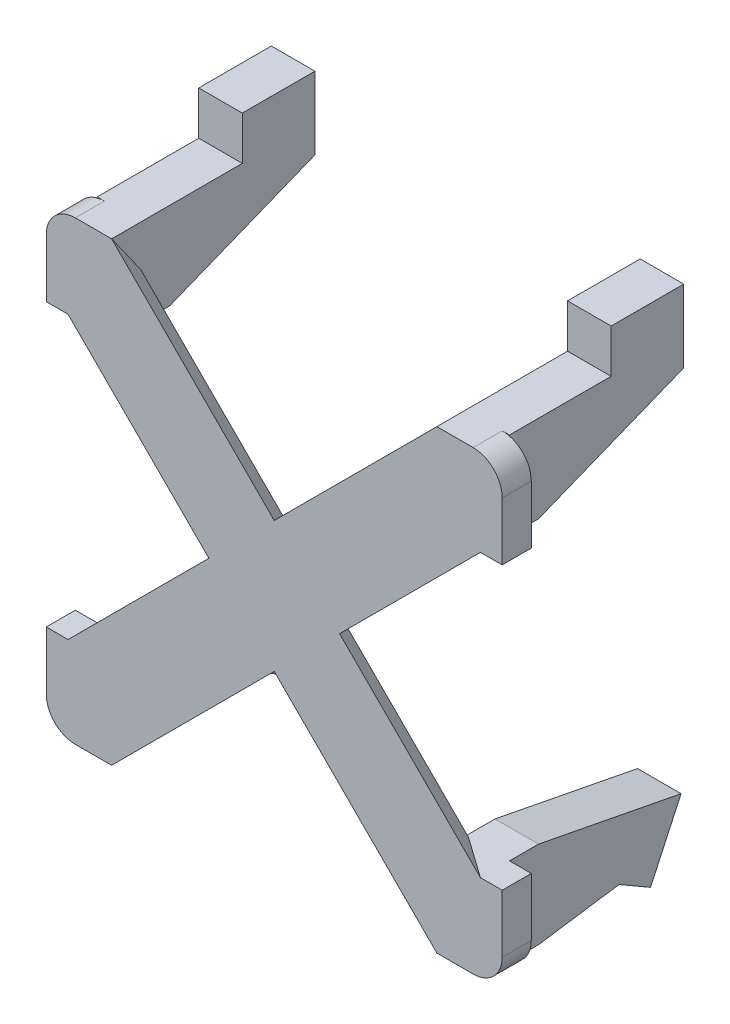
ISO-10303-21;
HEADER;
FILE_DESCRIPTION(('STEP AP214'),'2;1');
FILE_NAME('part.step','',(''),(''),'','','');
FILE_SCHEMA(('AUTOMOTIVE_DESIGN { 1 0 10303 214 1 1 1 1 }'));
ENDSEC;
DATA;
#1=APPLICATION_CONTEXT('core data for automotive mechanical design processes');
#2=APPLICATION_PROTOCOL_DEFINITION('international standard','automotive_design',2000,#1);
#3=PRODUCT_CONTEXT('',#1,'mechanical');
#4=PRODUCT('Part','Part','',(#3));
#5=PRODUCT_RELATED_PRODUCT_CATEGORY('part','',(#4));
#6=PRODUCT_DEFINITION_FORMATION('','',#4);
#7=PRODUCT_DEFINITION_CONTEXT('part definition',#1,'design');
#8=PRODUCT_DEFINITION('design','',#6,#7);
#9=PRODUCT_DEFINITION_SHAPE('','',#8);
#10=(LENGTH_UNIT() NAMED_UNIT(*) SI_UNIT(.MILLI.,.METRE.));
#11=(NAMED_UNIT(*) PLANE_ANGLE_UNIT() SI_UNIT($,.RADIAN.));
#12=(NAMED_UNIT(*) SI_UNIT($,.STERADIAN.) SOLID_ANGLE_UNIT());
#13=UNCERTAINTY_MEASURE_WITH_UNIT(LENGTH_MEASURE(1.E-05),#10,'distance_accuracy_value','');
#14=(GEOMETRIC_REPRESENTATION_CONTEXT(3) GLOBAL_UNCERTAINTY_ASSIGNED_CONTEXT((#13)) GLOBAL_UNIT_ASSIGNED_CONTEXT((#10,
#11,#12)) REPRESENTATION_CONTEXT('',''));
#15=CARTESIAN_POINT('',(0.,0.,0.));
#16=DIRECTION('',(0.,0.,1.));
#17=DIRECTION('',(1.,0.,0.));
#18=AXIS2_PLACEMENT_3D('',#15,#16,#17);
#19=CARTESIAN_POINT('',(0.,0.,0.));
#20=DIRECTION('',(0.,0.,1.));
#21=DIRECTION('',(1.,0.,0.));
#22=AXIS2_PLACEMENT_3D('',#19,#20,#21);
#23=PLANE('',#22);
#24=DIRECTION('',(0.,-1.,0.));
#25=VECTOR('',#24,1.);
#26=CARTESIAN_POINT('',(14.2,-9.7,0.));
#27=LINE('',#26,#25);
#28=CARTESIAN_POINT('',(14.2,-9.7,0.));
#29=VERTEX_POINT('',#28);
#30=CARTESIAN_POINT('',(14.2,-15.6364916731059,0.));
#31=VERTEX_POINT('',#30);
#32=EDGE_CURVE('E392',#29,#31,#27,.T.);
#33=ORIENTED_EDGE('',*,*,#32,.F.);
#34=DIRECTION('',(1.,0.,0.));
#35=VECTOR('',#34,1.);
#36=CARTESIAN_POINT('',(0.,-9.70000000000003,0.));
#37=LINE('',#36,#35);
#38=CARTESIAN_POINT('',(15.7,-9.7,0.));
#39=VERTEX_POINT('',#38);
#40=EDGE_CURVE('E1433',#29,#39,#37,.T.);
#41=ORIENTED_EDGE('',*,*,#40,.T.);
#42=DIRECTION('',(4.57966997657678E-13,-1.,0.));
#43=VECTOR('',#42,1.);
#44=CARTESIAN_POINT('',(15.6999999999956,7.19008186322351E-12,0.));
#45=LINE('',#44,#43);
#46=CARTESIAN_POINT('',(15.7000000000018,-13.7000000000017,0.));
#47=VERTEX_POINT('',#46);
#48=EDGE_CURVE('E754',#39,#47,#45,.T.);
#49=ORIENTED_EDGE('',*,*,#48,.T.);
#50=CARTESIAN_POINT('',(13.7000000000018,-13.7000000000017,0.));
#51=DIRECTION('',(0.,0.,1.));
#52=DIRECTION('',(1.,0.,0.));
#53=AXIS2_PLACEMENT_3D('',#50,#51,#52);
#54=CIRCLE('',#53,2.);
#55=EDGE_CURVE('E623',#31,#47,#54,.T.);
#56=ORIENTED_EDGE('',*,*,#55,.F.);
#57=EDGE_LOOP('',(#33,#41,#49,#56));
#58=FACE_BOUND('',#57,.T.);
#59=ADVANCED_FACE('F37',(#58),#23,.F.);
#60=DIRECTION('',(0.,-1.,0.));
#61=VECTOR('',#60,1.);
#62=CARTESIAN_POINT('',(14.2,0.,0.));
#63=LINE('',#62,#61);
#64=CARTESIAN_POINT('',(14.2,15.6364916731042,0.));
#65=VERTEX_POINT('',#64);
#66=CARTESIAN_POINT('',(14.2,9.70000000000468,0.));
#67=VERTEX_POINT('',#66);
#68=EDGE_CURVE('E644',#65,#67,#63,.T.);
#69=ORIENTED_EDGE('',*,*,#68,.F.);
#70=CARTESIAN_POINT('',(13.7000000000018,13.7,0.));
#71=DIRECTION('',(0.,0.,1.));
#72=DIRECTION('',(1.,0.,0.));
#73=AXIS2_PLACEMENT_3D('',#70,#71,#72);
#74=CIRCLE('',#73,2.);
#75=CARTESIAN_POINT('',(15.7000000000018,13.7,0.));
#76=VERTEX_POINT('',#75);
#77=EDGE_CURVE('E1441',#65,#76,#74,.F.);
#78=ORIENTED_EDGE('',*,*,#77,.T.);
#79=DIRECTION('',(0.,-1.,0.));
#80=VECTOR('',#79,1.);
#81=CARTESIAN_POINT('',(15.7000000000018,0.,0.));
#82=LINE('',#81,#80);
#83=CARTESIAN_POINT('',(15.7000000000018,9.70000000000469,0.));
#84=VERTEX_POINT('',#83);
#85=EDGE_CURVE('E1438',#76,#84,#82,.T.);
#86=ORIENTED_EDGE('',*,*,#85,.T.);
#87=DIRECTION('',(1.,0.,0.));
#88=VECTOR('',#87,1.);
#89=CARTESIAN_POINT('',(0.,9.70000000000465,0.));
#90=LINE('',#89,#88);
#91=EDGE_CURVE('E1434',#67,#84,#90,.T.);
#92=ORIENTED_EDGE('',*,*,#91,.F.);
#93=EDGE_LOOP('',(#69,#78,#86,#92));
#94=FACE_BOUND('',#93,.T.);
#95=ADVANCED_FACE('F882',(#94),#23,.F.);
#96=DIRECTION('',(0.,1.,0.));
#97=VECTOR('',#96,1.);
#98=CARTESIAN_POINT('',(-14.2,0.,0.));
#99=LINE('',#98,#97);
#100=CARTESIAN_POINT('',(-14.2,9.70000000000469,0.));
#101=VERTEX_POINT('',#100);
#102=CARTESIAN_POINT('',(-14.2,15.6364916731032,0.));
#103=VERTEX_POINT('',#102);
#104=EDGE_CURVE('E631',#101,#103,#99,.T.);
#105=ORIENTED_EDGE('',*,*,#104,.F.);
#106=DIRECTION('',(-1.,0.,0.));
#107=VECTOR('',#106,1.);
#108=CARTESIAN_POINT('',(0.,9.70000000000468,0.));
#109=LINE('',#108,#107);
#110=CARTESIAN_POINT('',(-15.6999999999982,9.70000000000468,0.));
#111=VERTEX_POINT('',#110);
#112=EDGE_CURVE('E612',#101,#111,#109,.T.);
#113=ORIENTED_EDGE('',*,*,#112,.T.);
#114=DIRECTION('',(0.,-1.,0.));
#115=VECTOR('',#114,1.);
#116=CARTESIAN_POINT('',(-15.6999999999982,0.,0.));
#117=LINE('',#116,#115);
#118=CARTESIAN_POINT('',(-15.6999999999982,13.7,0.));
#119=VERTEX_POINT('',#118);
#120=EDGE_CURVE('E609',#119,#111,#117,.T.);
#121=ORIENTED_EDGE('',*,*,#120,.F.);
#122=CARTESIAN_POINT('',(-13.6999999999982,13.7,0.));
#123=DIRECTION('',(0.,0.,1.));
#124=DIRECTION('',(1.,0.,0.));
#125=AXIS2_PLACEMENT_3D('',#122,#123,#124);
#126=CIRCLE('',#125,2.);
#127=EDGE_CURVE('E543',#103,#119,#126,.T.);
#128=ORIENTED_EDGE('',*,*,#127,.F.);
#129=EDGE_LOOP('',(#105,#113,#121,#128));
#130=FACE_BOUND('',#129,.T.);
#131=ADVANCED_FACE('F888',(#130),#23,.F.);
#132=CARTESIAN_POINT('',(-11.2,-9.7,0.));
#133=DIRECTION('',(0.,0.,-1.));
#134=DIRECTION('',(-1.,0.,0.));
#135=AXIS2_PLACEMENT_3D('',#132,#133,#134);
#136=PLANE('',#135);
#137=CARTESIAN_POINT('',(-13.6999999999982,-13.7000000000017,0.));
#138=DIRECTION('',(0.,0.,1.));
#139=DIRECTION('',(1.,0.,0.));
#140=AXIS2_PLACEMENT_3D('',#137,#138,#139);
#141=CIRCLE('',#140,2.);
#142=CARTESIAN_POINT('',(-14.2,-15.636491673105,0.));
#143=VERTEX_POINT('',#142);
#144=CARTESIAN_POINT('',(-13.6999999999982,-15.7000000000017,0.));
#145=VERTEX_POINT('',#144);
#146=EDGE_CURVE('E627',#143,#145,#141,.T.);
#147=ORIENTED_EDGE('',*,*,#146,.F.);
#148=DIRECTION('',(0.,-1.,0.));
#149=VECTOR('',#148,1.);
#150=CARTESIAN_POINT('',(-14.2,-9.7,0.));
#151=LINE('',#150,#149);
#152=CARTESIAN_POINT('',(-14.2,-15.7000000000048,0.));
#153=VERTEX_POINT('',#152);
#154=EDGE_CURVE('E796',#143,#153,#151,.T.);
#155=ORIENTED_EDGE('',*,*,#154,.T.);
#156=DIRECTION('',(-1.,0.,0.));
#157=VECTOR('',#156,1.);
#158=CARTESIAN_POINT('',(-11.2,-15.7000000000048,0.));
#159=LINE('',#158,#157);
#160=EDGE_CURVE('E632',#145,#153,#159,.T.);
#161=ORIENTED_EDGE('',*,*,#160,.F.);
#162=EDGE_LOOP('',(#147,#155,#161));
#163=FACE_BOUND('',#162,.T.);
#164=ADVANCED_FACE('F832',(#163),#136,.F.);
#165=CARTESIAN_POINT('',(-11.2,-15.7,-2.));
#166=DIRECTION('',(0.,1.,2.39912256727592E-12));
#167=DIRECTION('',(0.,-2.39912256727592E-12,1.));
#168=AXIS2_PLACEMENT_3D('',#165,#166,#167);
#169=PLANE('',#168);
#170=DIRECTION('',(0.,2.39912256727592E-12,-1.));
#171=VECTOR('',#170,1.);
#172=CARTESIAN_POINT('',(-14.2,-15.7,-2.));
#173=LINE('',#172,#171);
#174=CARTESIAN_POINT('',(-14.2,-15.7,-2.));
#175=VERTEX_POINT('',#174);
#176=EDGE_CURVE('E800',#153,#175,#173,.T.);
#177=ORIENTED_EDGE('',*,*,#176,.T.);
#178=DIRECTION('',(-1.,0.,0.));
#179=VECTOR('',#178,1.);
#180=CARTESIAN_POINT('',(-11.2,-15.7,-2.));
#181=LINE('',#180,#179);
#182=CARTESIAN_POINT('',(-11.2,-15.7,-2.));
#183=VERTEX_POINT('',#182);
#184=EDGE_CURVE('E820',#183,#175,#181,.T.);
#185=ORIENTED_EDGE('',*,*,#184,.F.);
#186=DIRECTION('',(0.,2.39912256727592E-12,-1.));
#187=VECTOR('',#186,1.);
#188=CARTESIAN_POINT('',(-11.2,-15.7,-2.));
#189=LINE('',#188,#187);
#190=CARTESIAN_POINT('',(-11.2000000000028,-15.7000000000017,2.));
#191=VERTEX_POINT('',#190);
#192=EDGE_CURVE('E783',#191,#183,#189,.T.);
#193=ORIENTED_EDGE('',*,*,#192,.F.);
#194=DIRECTION('',(1.,0.,0.));
#195=VECTOR('',#194,1.);
#196=CARTESIAN_POINT('',(0.,-15.7000000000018,2.));
#197=LINE('',#196,#195);
#198=CARTESIAN_POINT('',(-13.6999999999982,-15.7000000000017,2.));
#199=VERTEX_POINT('',#198);
#200=EDGE_CURVE('E564',#199,#191,#197,.T.);
#201=ORIENTED_EDGE('',*,*,#200,.F.);
#202=DIRECTION('',(0.,0.,-1.));
#203=VECTOR('',#202,1.);
#204=CARTESIAN_POINT('',(-13.6999999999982,-15.7000000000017,2.));
#205=LINE('',#204,#203);
#206=EDGE_CURVE('E635',#199,#145,#205,.T.);
#207=ORIENTED_EDGE('',*,*,#206,.T.);
#208=ORIENTED_EDGE('',*,*,#160,.T.);
#209=EDGE_LOOP('',(#177,#185,#193,#201,#207,#208));
#210=FACE_BOUND('',#209,.T.);
#211=ADVANCED_FACE('F825',(#210),#169,.F.);
#212=CARTESIAN_POINT('',(-11.2,-14.8854839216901,-7.54973782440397));
#213=DIRECTION('',(0.,0.98940071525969,0.145210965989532));
#214=DIRECTION('',(0.,-0.145210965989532,0.989400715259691));
#215=AXIS2_PLACEMENT_3D('',#212,#213,#214);
#216=PLANE('',#215);
#217=DIRECTION('',(0.,0.145210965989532,-0.98940071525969));
#218=VECTOR('',#217,1.);
#219=CARTESIAN_POINT('',(-14.2,-14.8854839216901,-7.54973782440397));
#220=LINE('',#219,#218);
#221=CARTESIAN_POINT('',(-14.2,-14.8854839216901,-7.54973782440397));
#222=VERTEX_POINT('',#221);
#223=EDGE_CURVE('E802',#175,#222,#220,.T.);
#224=ORIENTED_EDGE('',*,*,#223,.T.);
#225=DIRECTION('',(-1.,0.,0.));
#226=VECTOR('',#225,1.);
#227=CARTESIAN_POINT('',(-11.2,-14.8854839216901,-7.54973782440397));
#228=LINE('',#227,#226);
#229=CARTESIAN_POINT('',(-11.2,-14.8854839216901,-7.54973782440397));
#230=VERTEX_POINT('',#229);
#231=EDGE_CURVE('E817',#230,#222,#228,.T.);
#232=ORIENTED_EDGE('',*,*,#231,.F.);
#233=DIRECTION('',(0.,0.145210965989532,-0.98940071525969));
#234=VECTOR('',#233,1.);
#235=CARTESIAN_POINT('',(-11.2,-14.8854839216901,-7.54973782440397));
#236=LINE('',#235,#234);
#237=EDGE_CURVE('E785',#183,#230,#236,.T.);
#238=ORIENTED_EDGE('',*,*,#237,.F.);
#239=ORIENTED_EDGE('',*,*,#184,.T.);
#240=EDGE_LOOP('',(#224,#232,#238,#239));
#241=FACE_BOUND('',#240,.T.);
#242=ADVANCED_FACE('F841',(#241),#216,.F.);
#243=CARTESIAN_POINT('',(-11.2,-16.1381933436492,-9.71323478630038));
#244=DIRECTION('',(0.,0.865398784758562,-0.501083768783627));
#245=DIRECTION('',(0.,0.501083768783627,0.865398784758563));
#246=AXIS2_PLACEMENT_3D('',#243,#244,#245);
#247=PLANE('',#246);
#248=DIRECTION('',(0.,-0.501083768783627,-0.865398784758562));
#249=VECTOR('',#248,1.);
#250=CARTESIAN_POINT('',(-14.2,-16.1381933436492,-9.71323478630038));
#251=LINE('',#250,#249);
#252=CARTESIAN_POINT('',(-14.2,-16.1381933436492,-9.71323478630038));
#253=VERTEX_POINT('',#252);
#254=EDGE_CURVE('E804',#222,#253,#251,.T.);
#255=ORIENTED_EDGE('',*,*,#254,.T.);
#256=DIRECTION('',(-1.,0.,0.));
#257=VECTOR('',#256,1.);
#258=CARTESIAN_POINT('',(-11.2,-16.1381933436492,-9.71323478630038));
#259=LINE('',#258,#257);
#260=CARTESIAN_POINT('',(-11.2,-16.1381933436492,-9.71323478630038));
#261=VERTEX_POINT('',#260);
#262=EDGE_CURVE('E814',#261,#253,#259,.T.);
#263=ORIENTED_EDGE('',*,*,#262,.F.);
#264=DIRECTION('',(0.,-0.501083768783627,-0.865398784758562));
#265=VECTOR('',#264,1.);
#266=CARTESIAN_POINT('',(-11.2,-16.1381933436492,-9.71323478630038));
#267=LINE('',#266,#265);
#268=EDGE_CURVE('E787',#230,#261,#267,.T.);
#269=ORIENTED_EDGE('',*,*,#268,.F.);
#270=ORIENTED_EDGE('',*,*,#231,.T.);
#271=EDGE_LOOP('',(#255,#263,#269,#270));
#272=FACE_BOUND('',#271,.T.);
#273=ADVANCED_FACE('F845',(#272),#247,.F.);
#274=CARTESIAN_POINT('',(-11.2,-11.6024841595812,-11.8173598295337));
#275=DIRECTION('',(0.,0.42082500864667,0.907141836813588));
#276=DIRECTION('',(0.,-0.907141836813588,0.42082500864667));
#277=AXIS2_PLACEMENT_3D('',#274,#275,#276);
#278=PLANE('',#277);
#279=DIRECTION('',(0.,0.907141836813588,-0.42082500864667));
#280=VECTOR('',#279,1.);
#281=CARTESIAN_POINT('',(-14.2,-11.6024841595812,-11.8173598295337));
#282=LINE('',#281,#280);
#283=CARTESIAN_POINT('',(-14.2,-11.6024841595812,-11.8173598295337));
#284=VERTEX_POINT('',#283);
#285=EDGE_CURVE('E806',#253,#284,#282,.T.);
#286=ORIENTED_EDGE('',*,*,#285,.T.);
#287=DIRECTION('',(-1.,0.,0.));
#288=VECTOR('',#287,1.);
#289=CARTESIAN_POINT('',(-11.2,-11.6024841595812,-11.8173598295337));
#290=LINE('',#289,#288);
#291=CARTESIAN_POINT('',(-11.2,-11.6024841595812,-11.8173598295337));
#292=VERTEX_POINT('',#291);
#293=EDGE_CURVE('E811',#292,#284,#290,.T.);
#294=ORIENTED_EDGE('',*,*,#293,.F.);
#295=DIRECTION('',(0.,0.907141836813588,-0.42082500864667));
#296=VECTOR('',#295,1.);
#297=CARTESIAN_POINT('',(-11.2,-11.6024841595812,-11.8173598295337));
#298=LINE('',#297,#296);
#299=EDGE_CURVE('E789',#261,#292,#298,.T.);
#300=ORIENTED_EDGE('',*,*,#299,.F.);
#301=ORIENTED_EDGE('',*,*,#262,.T.);
#302=EDGE_LOOP('',(#286,#294,#300,#301));
#303=FACE_BOUND('',#302,.T.);
#304=ADVANCED_FACE('F872',(#303),#278,.F.);
#305=CARTESIAN_POINT('',(-11.2,-9.7,-2.));
#306=DIRECTION('',(0.,-0.981735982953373,0.190248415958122));
#307=DIRECTION('',(0.,-0.190248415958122,-0.981735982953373));
#308=AXIS2_PLACEMENT_3D('',#305,#306,#307);
#309=PLANE('',#308);
#310=DIRECTION('',(0.,0.190248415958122,0.981735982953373));
#311=VECTOR('',#310,1.);
#312=CARTESIAN_POINT('',(-14.2,-9.7,-2.));
#313=LINE('',#312,#311);
#314=CARTESIAN_POINT('',(-14.2,-9.7,-2.));
#315=VERTEX_POINT('',#314);
#316=EDGE_CURVE('E780',#284,#315,#313,.T.);
#317=ORIENTED_EDGE('',*,*,#316,.T.);
#318=DIRECTION('',(-1.,0.,0.));
#319=VECTOR('',#318,1.);
#320=CARTESIAN_POINT('',(-11.2,-9.7,-2.));
#321=LINE('',#320,#319);
#322=CARTESIAN_POINT('',(-11.2,-9.7,-2.));
#323=VERTEX_POINT('',#322);
#324=EDGE_CURVE('E793',#323,#315,#321,.T.);
#325=ORIENTED_EDGE('',*,*,#324,.F.);
#326=DIRECTION('',(0.,0.190248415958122,0.981735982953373));
#327=VECTOR('',#326,1.);
#328=CARTESIAN_POINT('',(-11.2,-9.7,-2.));
#329=LINE('',#328,#327);
#330=EDGE_CURVE('E791',#292,#323,#329,.T.);
#331=ORIENTED_EDGE('',*,*,#330,.F.);
#332=ORIENTED_EDGE('',*,*,#293,.T.);
#333=EDGE_LOOP('',(#317,#325,#331,#332));
#334=FACE_BOUND('',#333,.T.);
#335=ADVANCED_FACE('F870',(#334),#309,.F.);
#336=CARTESIAN_POINT('',(-11.2,0.,0.));
#337=DIRECTION('',(1.,0.,0.));
#338=DIRECTION('',(0.,0.,-1.));
#339=AXIS2_PLACEMENT_3D('',#336,#337,#338);
#340=PLANE('',#339);
#341=DIRECTION('',(0.,0.,1.));
#342=VECTOR('',#341,1.);
#343=CARTESIAN_POINT('',(-11.2,-9.7,-2.));
#344=LINE('',#343,#342);
#345=CARTESIAN_POINT('',(-11.2,-9.7,0.));
#346=VERTEX_POINT('',#345);
#347=EDGE_CURVE('E777',#323,#346,#344,.T.);
#348=ORIENTED_EDGE('',*,*,#347,.T.);
#349=DIRECTION('',(0.,-1.,0.));
#350=VECTOR('',#349,1.);
#351=CARTESIAN_POINT('',(-11.2,-9.7,0.));
#352=LINE('',#351,#350);
#353=CARTESIAN_POINT('',(-11.2,-12.8715728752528,0.));
#354=VERTEX_POINT('',#353);
#355=EDGE_CURVE('E779',#346,#354,#352,.T.);
#356=ORIENTED_EDGE('',*,*,#355,.T.);
#357=DIRECTION('',(0.,-0.816496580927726,0.577350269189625));
#358=VECTOR('',#357,1.);
#359=CARTESIAN_POINT('',(-11.2,-4.84771525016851,-5.67372413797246));
#360=LINE('',#359,#358);
#361=EDGE_CURVE('E665',#354,#191,#360,.T.);
#362=ORIENTED_EDGE('',*,*,#361,.T.);
#363=ORIENTED_EDGE('',*,*,#192,.T.);
#364=ORIENTED_EDGE('',*,*,#237,.T.);
#365=ORIENTED_EDGE('',*,*,#268,.T.);
#366=ORIENTED_EDGE('',*,*,#299,.T.);
#367=ORIENTED_EDGE('',*,*,#330,.T.);
#368=EDGE_LOOP('',(#348,#356,#362,#363,#364,#365,#366,#367));
#369=FACE_BOUND('',#368,.T.);
#370=ADVANCED_FACE('F849',(#369),#340,.T.);
#371=CARTESIAN_POINT('',(-14.2,0.,0.));
#372=DIRECTION('',(1.,0.,0.));
#373=DIRECTION('',(0.,0.,-1.));
#374=AXIS2_PLACEMENT_3D('',#371,#372,#373);
#375=PLANE('',#374);
#376=DIRECTION('',(0.,0.,1.));
#377=VECTOR('',#376,1.);
#378=CARTESIAN_POINT('',(-14.2,-9.7,-2.));
#379=LINE('',#378,#377);
#380=CARTESIAN_POINT('',(-14.2,-9.7,0.));
#381=VERTEX_POINT('',#380);
#382=EDGE_CURVE('E776',#315,#381,#379,.T.);
#383=ORIENTED_EDGE('',*,*,#382,.F.);
#384=ORIENTED_EDGE('',*,*,#316,.F.);
#385=ORIENTED_EDGE('',*,*,#285,.F.);
#386=ORIENTED_EDGE('',*,*,#254,.F.);
#387=ORIENTED_EDGE('',*,*,#223,.F.);
#388=ORIENTED_EDGE('',*,*,#176,.F.);
#389=ORIENTED_EDGE('',*,*,#154,.F.);
#390=EDGE_CURVE('E797',#381,#143,#151,.T.);
#391=ORIENTED_EDGE('',*,*,#390,.F.);
#392=EDGE_LOOP('',(#383,#384,#385,#386,#387,#388,#389,#391));
#393=FACE_BOUND('',#392,.T.);
#394=ADVANCED_FACE('F836',(#393),#375,.F.);
#395=DIRECTION('',(-1.,0.,0.));
#396=VECTOR('',#395,1.);
#397=CARTESIAN_POINT('',(0.,-9.7,0.));
#398=LINE('',#397,#396);
#399=CARTESIAN_POINT('',(-15.7,-9.7,0.));
#400=VERTEX_POINT('',#399);
#401=EDGE_CURVE('E615',#381,#400,#398,.T.);
#402=ORIENTED_EDGE('',*,*,#401,.F.);
#403=ORIENTED_EDGE('',*,*,#390,.T.);
#404=CARTESIAN_POINT('',(-15.6999999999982,-13.7000000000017,0.));
#405=VERTEX_POINT('',#404);
#406=EDGE_CURVE('E619',#405,#143,#141,.T.);
#407=ORIENTED_EDGE('',*,*,#406,.F.);
#408=DIRECTION('',(4.58834359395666E-13,-1.,0.));
#409=VECTOR('',#408,1.);
#410=CARTESIAN_POINT('',(-15.7000000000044,-7.203699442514E-12,0.));
#411=LINE('',#410,#409);
#412=EDGE_CURVE('E617',#400,#405,#411,.T.);
#413=ORIENTED_EDGE('',*,*,#412,.F.);
#414=EDGE_LOOP('',(#402,#403,#407,#413));
#415=FACE_BOUND('',#414,.T.);
#416=ADVANCED_FACE('F861',(#415),#23,.F.);
#417=CARTESIAN_POINT('',(0.,15.7,2.));
#418=DIRECTION('',(0.,1.,0.));
#419=DIRECTION('',(0.,0.,1.));
#420=AXIS2_PLACEMENT_3D('',#417,#418,#419);
#421=PLANE('',#420);
#422=DIRECTION('',(1.,0.,0.));
#423=VECTOR('',#422,1.);
#424=CARTESIAN_POINT('',(0.,15.7,2.));
#425=LINE('',#424,#423);
#426=CARTESIAN_POINT('',(-13.6999999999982,15.7,2.));
#427=VERTEX_POINT('',#426);
#428=CARTESIAN_POINT('',(-11.2,15.7,2.));
#429=VERTEX_POINT('',#428);
#430=EDGE_CURVE('E544',#427,#429,#425,.T.);
#431=ORIENTED_EDGE('',*,*,#430,.T.);
#432=DIRECTION('',(0.,0.,1.));
#433=VECTOR('',#432,1.);
#434=CARTESIAN_POINT('',(-11.2,15.7,-2.));
#435=LINE('',#434,#433);
#436=CARTESIAN_POINT('',(-11.2,15.7,-7.));
#437=VERTEX_POINT('',#436);
#438=EDGE_CURVE('E493',#437,#429,#435,.T.);
#439=ORIENTED_EDGE('',*,*,#438,.F.);
#440=DIRECTION('',(-1.,0.,0.));
#441=VECTOR('',#440,1.);
#442=CARTESIAN_POINT('',(-11.2,15.7,-7.));
#443=LINE('',#442,#441);
#444=CARTESIAN_POINT('',(-14.2,15.7,-7.));
#445=VERTEX_POINT('',#444);
#446=EDGE_CURVE('E509',#437,#445,#443,.T.);
#447=ORIENTED_EDGE('',*,*,#446,.T.);
#448=DIRECTION('',(0.,0.,1.));
#449=VECTOR('',#448,1.);
#450=CARTESIAN_POINT('',(-14.2,15.7,-2.));
#451=LINE('',#450,#449);
#452=CARTESIAN_POINT('',(-14.2,15.7,0.));
#453=VERTEX_POINT('',#452);
#454=EDGE_CURVE('E496',#445,#453,#451,.T.);
#455=ORIENTED_EDGE('',*,*,#454,.T.);
#456=DIRECTION('',(-1.,0.,0.));
#457=VECTOR('',#456,1.);
#458=CARTESIAN_POINT('',(-11.2,15.7,0.));
#459=LINE('',#458,#457);
#460=CARTESIAN_POINT('',(-13.6999999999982,15.7,0.));
#461=VERTEX_POINT('',#460);
#462=EDGE_CURVE('E541',#461,#453,#459,.T.);
#463=ORIENTED_EDGE('',*,*,#462,.F.);
#464=DIRECTION('',(0.,0.,-1.));
#465=VECTOR('',#464,1.);
#466=CARTESIAN_POINT('',(-13.6999999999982,15.7,2.));
#467=LINE('',#466,#465);
#468=EDGE_CURVE('E774',#427,#461,#467,.T.);
#469=ORIENTED_EDGE('',*,*,#468,.F.);
#470=EDGE_LOOP('',(#431,#439,#447,#455,#463,#469));
#471=FACE_BOUND('',#470,.T.);
#472=ADVANCED_FACE('F902',(#471),#421,.T.);
#473=CARTESIAN_POINT('',(-13.6999999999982,13.7,2.));
#474=DIRECTION('',(0.,0.,-1.));
#475=DIRECTION('',(-1.,0.,0.));
#476=AXIS2_PLACEMENT_3D('',#473,#474,#475);
#477=CYLINDRICAL_SURFACE('',#476,2.);
#478=EDGE_CURVE('E607',#461,#103,#126,.T.);
#479=ORIENTED_EDGE('',*,*,#478,.T.);
#480=ORIENTED_EDGE('',*,*,#127,.T.);
#481=DIRECTION('',(0.,0.,-1.));
#482=VECTOR('',#481,1.);
#483=CARTESIAN_POINT('',(-15.6999999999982,13.7,2.));
#484=LINE('',#483,#482);
#485=CARTESIAN_POINT('',(-15.6999999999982,13.7,2.));
#486=VERTEX_POINT('',#485);
#487=EDGE_CURVE('E771',#486,#119,#484,.T.);
#488=ORIENTED_EDGE('',*,*,#487,.F.);
#489=CARTESIAN_POINT('',(-13.6999999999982,13.7,2.));
#490=DIRECTION('',(0.,0.,1.));
#491=DIRECTION('',(1.,0.,0.));
#492=AXIS2_PLACEMENT_3D('',#489,#490,#491);
#493=CIRCLE('',#492,2.);
#494=EDGE_CURVE('E547',#427,#486,#493,.T.);
#495=ORIENTED_EDGE('',*,*,#494,.F.);
#496=ORIENTED_EDGE('',*,*,#468,.T.);
#497=EDGE_LOOP('',(#479,#480,#488,#495,#496));
#498=FACE_BOUND('',#497,.T.);
#499=ADVANCED_FACE('F907',(#498),#477,.T.);
#500=CARTESIAN_POINT('',(-15.6999999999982,0.,2.));
#501=DIRECTION('',(1.,0.,0.));
#502=DIRECTION('',(0.,1.,0.));
#503=AXIS2_PLACEMENT_3D('',#500,#501,#502);
#504=PLANE('',#503);
#505=ORIENTED_EDGE('',*,*,#120,.T.);
#506=DIRECTION('',(0.,0.,-1.));
#507=VECTOR('',#506,1.);
#508=CARTESIAN_POINT('',(-15.6999999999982,9.70000000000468,2.));
#509=LINE('',#508,#507);
#510=CARTESIAN_POINT('',(-15.6999999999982,9.70000000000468,2.));
#511=VERTEX_POINT('',#510);
#512=EDGE_CURVE('E769',#511,#111,#509,.T.);
#513=ORIENTED_EDGE('',*,*,#512,.F.);
#514=DIRECTION('',(0.,-1.,0.));
#515=VECTOR('',#514,1.);
#516=CARTESIAN_POINT('',(-15.6999999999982,0.,2.));
#517=LINE('',#516,#515);
#518=EDGE_CURVE('E550',#486,#511,#517,.T.);
#519=ORIENTED_EDGE('',*,*,#518,.F.);
#520=ORIENTED_EDGE('',*,*,#487,.T.);
#521=EDGE_LOOP('',(#505,#513,#519,#520));
#522=FACE_BOUND('',#521,.T.);
#523=ADVANCED_FACE('F951',(#522),#504,.F.);
#524=CARTESIAN_POINT('',(0.,-9.7,2.));
#525=DIRECTION('',(0.,-1.,0.));
#526=DIRECTION('',(0.,0.,-1.));
#527=AXIS2_PLACEMENT_3D('',#524,#525,#526);
#528=PLANE('',#527);
#529=ORIENTED_EDGE('',*,*,#401,.T.);
#530=DIRECTION('',(0.,0.,-1.));
#531=VECTOR('',#530,1.);
#532=CARTESIAN_POINT('',(-15.7,-9.7,2.));
#533=LINE('',#532,#531);
#534=CARTESIAN_POINT('',(-15.7,-9.7,2.));
#535=VERTEX_POINT('',#534);
#536=EDGE_CURVE('E766',#535,#400,#533,.T.);
#537=ORIENTED_EDGE('',*,*,#536,.F.);
#538=DIRECTION('',(-1.,0.,0.));
#539=VECTOR('',#538,1.);
#540=CARTESIAN_POINT('',(0.,-9.7,2.));
#541=LINE('',#540,#539);
#542=CARTESIAN_POINT('',(-14.2,-9.7,2.));
#543=VERTEX_POINT('',#542);
#544=EDGE_CURVE('E558',#543,#535,#541,.T.);
#545=ORIENTED_EDGE('',*,*,#544,.F.);
#546=DIRECTION('',(-0.816496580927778,0.,0.577350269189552));
#547=VECTOR('',#546,1.);
#548=CARTESIAN_POINT('',(-4.73333333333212,-9.7,-4.69394419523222));
#549=LINE('',#548,#547);
#550=CARTESIAN_POINT('',(-11.3715728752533,-9.7,0.));
#551=VERTEX_POINT('',#550);
#552=EDGE_CURVE('E46',#543,#551,#549,.F.);
#553=ORIENTED_EDGE('',*,*,#552,.T.);
#554=DIRECTION('',(-1.,0.,0.));
#555=VECTOR('',#554,1.);
#556=CARTESIAN_POINT('',(-11.2,-9.7,0.));
#557=LINE('',#556,#555);
#558=EDGE_CURVE('E61',#346,#551,#557,.T.);
#559=ORIENTED_EDGE('',*,*,#558,.F.);
#560=ORIENTED_EDGE('',*,*,#347,.F.);
#561=ORIENTED_EDGE('',*,*,#324,.T.);
#562=ORIENTED_EDGE('',*,*,#382,.T.);
#563=EDGE_LOOP('',(#529,#537,#545,#553,#559,#560,#561,#562));
#564=FACE_BOUND('',#563,.T.);
#565=ADVANCED_FACE('F864',(#564),#528,.F.);
#566=CARTESIAN_POINT('',(-15.7000000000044,-7.203699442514E-12,2.));
#567=DIRECTION('',(1.,4.58834359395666E-13,0.));
#568=DIRECTION('',(-4.58834359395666E-13,1.,0.));
#569=AXIS2_PLACEMENT_3D('',#566,#567,#568);
#570=PLANE('',#569);
#571=ORIENTED_EDGE('',*,*,#412,.T.);
#572=DIRECTION('',(0.,0.,-1.));
#573=VECTOR('',#572,1.);
#574=CARTESIAN_POINT('',(-15.6999999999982,-13.7000000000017,2.));
#575=LINE('',#574,#573);
#576=CARTESIAN_POINT('',(-15.6999999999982,-13.7000000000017,2.));
#577=VERTEX_POINT('',#576);
#578=EDGE_CURVE('E638',#577,#405,#575,.T.);
#579=ORIENTED_EDGE('',*,*,#578,.F.);
#580=DIRECTION('',(4.58834359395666E-13,-1.,0.));
#581=VECTOR('',#580,1.);
#582=CARTESIAN_POINT('',(-15.7000000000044,-7.203699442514E-12,2.));
#583=LINE('',#582,#581);
#584=EDGE_CURVE('E560',#535,#577,#583,.T.);
#585=ORIENTED_EDGE('',*,*,#584,.F.);
#586=ORIENTED_EDGE('',*,*,#536,.T.);
#587=EDGE_LOOP('',(#571,#579,#585,#586));
#588=FACE_BOUND('',#587,.T.);
#589=ADVANCED_FACE('F958',(#588),#570,.F.);
#590=CARTESIAN_POINT('',(-13.6999999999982,-13.7000000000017,2.));
#591=DIRECTION('',(0.,0.,-1.));
#592=DIRECTION('',(-1.,0.,0.));
#593=AXIS2_PLACEMENT_3D('',#590,#591,#592);
#594=CYLINDRICAL_SURFACE('',#593,2.);
#595=ORIENTED_EDGE('',*,*,#406,.T.);
#596=ORIENTED_EDGE('',*,*,#146,.T.);
#597=ORIENTED_EDGE('',*,*,#206,.F.);
#598=CARTESIAN_POINT('',(-13.6999999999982,-13.7000000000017,2.));
#599=DIRECTION('',(0.,0.,1.));
#600=DIRECTION('',(1.,0.,0.));
#601=AXIS2_PLACEMENT_3D('',#598,#599,#600);
#602=CIRCLE('',#601,2.);
#603=EDGE_CURVE('E562',#577,#199,#602,.T.);
#604=ORIENTED_EDGE('',*,*,#603,.F.);
#605=ORIENTED_EDGE('',*,*,#578,.T.);
#606=EDGE_LOOP('',(#595,#596,#597,#604,#605));
#607=FACE_BOUND('',#606,.T.);
#608=ADVANCED_FACE('F856',(#607),#594,.T.);
#609=CARTESIAN_POINT('',(0.,-15.7000000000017,2.));
#610=DIRECTION('',(0.,1.,0.));
#611=DIRECTION('',(0.,0.,1.));
#612=AXIS2_PLACEMENT_3D('',#609,#610,#611);
#613=PLANE('',#612);
#614=DIRECTION('',(1.,0.,0.));
#615=VECTOR('',#614,1.);
#616=CARTESIAN_POINT('',(0.,-15.7000000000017,2.));
#617=LINE('',#616,#615);
#618=CARTESIAN_POINT('',(11.2,-15.7000000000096,2.00000000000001));
#619=VERTEX_POINT('',#618);
#620=CARTESIAN_POINT('',(13.7000000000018,-15.7000000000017,2.));
#621=VERTEX_POINT('',#620);
#622=EDGE_CURVE('E573',#619,#621,#617,.T.);
#623=ORIENTED_EDGE('',*,*,#622,.F.);
#624=DIRECTION('',(0.,2.39912256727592E-12,-1.));
#625=VECTOR('',#624,1.);
#626=CARTESIAN_POINT('',(11.2,-15.7,-2.));
#627=LINE('',#626,#625);
#628=CARTESIAN_POINT('',(11.2,-15.7,-2.));
#629=VERTEX_POINT('',#628);
#630=EDGE_CURVE('E405',#619,#629,#627,.T.);
#631=ORIENTED_EDGE('',*,*,#630,.T.);
#632=DIRECTION('',(1.,0.,0.));
#633=VECTOR('',#632,1.);
#634=CARTESIAN_POINT('',(11.2,-15.7,-2.));
#635=LINE('',#634,#633);
#636=CARTESIAN_POINT('',(14.2,-15.7,-2.));
#637=VERTEX_POINT('',#636);
#638=EDGE_CURVE('E432',#629,#637,#635,.T.);
#639=ORIENTED_EDGE('',*,*,#638,.T.);
#640=DIRECTION('',(0.,2.39912256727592E-12,-1.));
#641=VECTOR('',#640,1.);
#642=CARTESIAN_POINT('',(14.2,-15.7,-2.));
#643=LINE('',#642,#641);
#644=CARTESIAN_POINT('',(14.2,-15.7000000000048,0.));
#645=VERTEX_POINT('',#644);
#646=EDGE_CURVE('E423',#645,#637,#643,.T.);
#647=ORIENTED_EDGE('',*,*,#646,.F.);
#648=DIRECTION('',(1.,0.,0.));
#649=VECTOR('',#648,1.);
#650=CARTESIAN_POINT('',(11.2,-15.7000000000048,0.));
#651=LINE('',#650,#649);
#652=CARTESIAN_POINT('',(13.7000000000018,-15.7000000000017,0.));
#653=VERTEX_POINT('',#652);
#654=EDGE_CURVE('E430',#653,#645,#651,.T.);
#655=ORIENTED_EDGE('',*,*,#654,.F.);
#656=DIRECTION('',(0.,0.,-1.));
#657=VECTOR('',#656,1.);
#658=CARTESIAN_POINT('',(13.7000000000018,-15.7000000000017,2.));
#659=LINE('',#658,#657);
#660=EDGE_CURVE('E639',#621,#653,#659,.T.);
#661=ORIENTED_EDGE('',*,*,#660,.F.);
#662=EDGE_LOOP('',(#623,#631,#639,#647,#655,#661));
#663=FACE_BOUND('',#662,.T.);
#664=ADVANCED_FACE('F1011',(#663),#613,.F.);
#665=CARTESIAN_POINT('',(13.7000000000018,-13.7000000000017,2.));
#666=DIRECTION('',(0.,0.,-1.));
#667=DIRECTION('',(-1.,0.,0.));
#668=AXIS2_PLACEMENT_3D('',#665,#666,#667);
#669=CYLINDRICAL_SURFACE('',#668,2.);
#670=EDGE_CURVE('E624',#653,#31,#54,.T.);
#671=ORIENTED_EDGE('',*,*,#670,.T.);
#672=ORIENTED_EDGE('',*,*,#55,.T.);
#673=DIRECTION('',(0.,0.,-1.));
#674=VECTOR('',#673,1.);
#675=CARTESIAN_POINT('',(15.7000000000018,-13.7000000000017,2.));
#676=LINE('',#675,#674);
#677=CARTESIAN_POINT('',(15.7000000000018,-13.7000000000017,2.));
#678=VERTEX_POINT('',#677);
#679=EDGE_CURVE('E751',#678,#47,#676,.T.);
#680=ORIENTED_EDGE('',*,*,#679,.F.);
#681=CARTESIAN_POINT('',(13.7000000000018,-13.7000000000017,2.));
#682=DIRECTION('',(0.,0.,1.));
#683=DIRECTION('',(1.,0.,0.));
#684=AXIS2_PLACEMENT_3D('',#681,#682,#683);
#685=CIRCLE('',#684,2.);
#686=EDGE_CURVE('E575',#621,#678,#685,.T.);
#687=ORIENTED_EDGE('',*,*,#686,.F.);
#688=ORIENTED_EDGE('',*,*,#660,.T.);
#689=EDGE_LOOP('',(#671,#672,#680,#687,#688));
#690=FACE_BOUND('',#689,.T.);
#691=ADVANCED_FACE('F1022',(#690),#669,.T.);
#692=CARTESIAN_POINT('',(15.6999999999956,7.19008186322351E-12,2.));
#693=DIRECTION('',(1.,4.57966997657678E-13,0.));
#694=DIRECTION('',(-4.57966997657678E-13,1.,0.));
#695=AXIS2_PLACEMENT_3D('',#692,#693,#694);
#696=PLANE('',#695);
#697=ORIENTED_EDGE('',*,*,#48,.F.);
#698=DIRECTION('',(0.,0.,-1.));
#699=VECTOR('',#698,1.);
#700=CARTESIAN_POINT('',(15.7,-9.7,2.));
#701=LINE('',#700,#699);
#702=CARTESIAN_POINT('',(15.7,-9.7,2.));
#703=VERTEX_POINT('',#702);
#704=EDGE_CURVE('E753',#703,#39,#701,.T.);
#705=ORIENTED_EDGE('',*,*,#704,.F.);
#706=DIRECTION('',(4.57966997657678E-13,-1.,0.));
#707=VECTOR('',#706,1.);
#708=CARTESIAN_POINT('',(15.6999999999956,7.19008186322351E-12,2.));
#709=LINE('',#708,#707);
#710=EDGE_CURVE('E577',#703,#678,#709,.T.);
#711=ORIENTED_EDGE('',*,*,#710,.T.);
#712=ORIENTED_EDGE('',*,*,#679,.T.);
#713=EDGE_LOOP('',(#697,#705,#711,#712));
#714=FACE_BOUND('',#713,.T.);
#715=ADVANCED_FACE('F750',(#714),#696,.T.);
#716=CARTESIAN_POINT('',(0.,9.70000000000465,2.));
#717=DIRECTION('',(0.,1.,0.));
#718=DIRECTION('',(-1.,0.,0.));
#719=AXIS2_PLACEMENT_3D('',#716,#717,#718);
#720=PLANE('',#719);
#721=ORIENTED_EDGE('',*,*,#91,.T.);
#722=DIRECTION('',(0.,0.,-1.));
#723=VECTOR('',#722,1.);
#724=CARTESIAN_POINT('',(15.7000000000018,9.70000000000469,2.));
#725=LINE('',#724,#723);
#726=CARTESIAN_POINT('',(15.7000000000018,9.70000000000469,2.));
#727=VERTEX_POINT('',#726);
#728=EDGE_CURVE('E756',#727,#84,#725,.T.);
#729=ORIENTED_EDGE('',*,*,#728,.F.);
#730=DIRECTION('',(1.,0.,0.));
#731=VECTOR('',#730,1.);
#732=CARTESIAN_POINT('',(0.,9.70000000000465,2.));
#733=LINE('',#732,#731);
#734=CARTESIAN_POINT('',(14.2000000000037,9.70000000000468,2.));
#735=VERTEX_POINT('',#734);
#736=EDGE_CURVE('E589',#735,#727,#733,.T.);
#737=ORIENTED_EDGE('',*,*,#736,.F.);
#738=DIRECTION('',(-0.816496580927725,0.,-0.577350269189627));
#739=VECTOR('',#738,1.);
#740=CARTESIAN_POINT('',(4.73333333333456,9.70000000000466,-4.69394419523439));
#741=LINE('',#740,#739);
#742=CARTESIAN_POINT('',(11.3715728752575,9.70000000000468,0.));
#743=VERTEX_POINT('',#742);
#744=EDGE_CURVE('E673',#735,#743,#741,.T.);
#745=ORIENTED_EDGE('',*,*,#744,.T.);
#746=DIRECTION('',(1.,0.,0.));
#747=VECTOR('',#746,1.);
#748=CARTESIAN_POINT('',(11.2,9.70000000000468,0.));
#749=LINE('',#748,#747);
#750=CARTESIAN_POINT('',(11.2,9.70000000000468,0.));
#751=VERTEX_POINT('',#750);
#752=EDGE_CURVE('E480',#751,#743,#749,.T.);
#753=ORIENTED_EDGE('',*,*,#752,.F.);
#754=DIRECTION('',(0.,-2.34187669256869E-12,-1.));
#755=VECTOR('',#754,1.);
#756=CARTESIAN_POINT('',(11.2,9.7,-2.));
#757=LINE('',#756,#755);
#758=CARTESIAN_POINT('',(11.2,9.7,-2.));
#759=VERTEX_POINT('',#758);
#760=EDGE_CURVE('E454',#751,#759,#757,.T.);
#761=ORIENTED_EDGE('',*,*,#760,.T.);
#762=DIRECTION('',(1.,0.,0.));
#763=VECTOR('',#762,1.);
#764=CARTESIAN_POINT('',(11.2,9.7,-2.));
#765=LINE('',#764,#763);
#766=CARTESIAN_POINT('',(14.2,9.7,-2.));
#767=VERTEX_POINT('',#766);
#768=EDGE_CURVE('E482',#759,#767,#765,.T.);
#769=ORIENTED_EDGE('',*,*,#768,.T.);
#770=DIRECTION('',(0.,-2.34187669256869E-12,-1.));
#771=VECTOR('',#770,1.);
#772=CARTESIAN_POINT('',(14.2,9.7,-2.));
#773=LINE('',#772,#771);
#774=EDGE_CURVE('E474',#67,#767,#773,.T.);
#775=ORIENTED_EDGE('',*,*,#774,.F.);
#776=EDGE_LOOP('',(#721,#729,#737,#745,#753,#761,#769,#775));
#777=FACE_BOUND('',#776,.T.);
#778=ADVANCED_FACE('F733',(#777),#720,.F.);
#779=CARTESIAN_POINT('',(15.7000000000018,0.,2.));
#780=DIRECTION('',(1.,0.,0.));
#781=DIRECTION('',(0.,0.,-1.));
#782=AXIS2_PLACEMENT_3D('',#779,#780,#781);
#783=PLANE('',#782);
#784=ORIENTED_EDGE('',*,*,#85,.F.);
#785=DIRECTION('',(0.,0.,-1.));
#786=VECTOR('',#785,1.);
#787=CARTESIAN_POINT('',(15.7000000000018,13.7,2.));
#788=LINE('',#787,#786);
#789=CARTESIAN_POINT('',(15.7000000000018,13.7,2.));
#790=VERTEX_POINT('',#789);
#791=EDGE_CURVE('E759',#790,#76,#788,.T.);
#792=ORIENTED_EDGE('',*,*,#791,.F.);
#793=DIRECTION('',(0.,-1.,0.));
#794=VECTOR('',#793,1.);
#795=CARTESIAN_POINT('',(15.7000000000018,0.,2.));
#796=LINE('',#795,#794);
#797=EDGE_CURVE('E591',#790,#727,#796,.T.);
#798=ORIENTED_EDGE('',*,*,#797,.T.);
#799=ORIENTED_EDGE('',*,*,#728,.T.);
#800=EDGE_LOOP('',(#784,#792,#798,#799));
#801=FACE_BOUND('',#800,.T.);
#802=ADVANCED_FACE('F1031',(#801),#783,.T.);
#803=CARTESIAN_POINT('',(13.7000000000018,13.7,2.));
#804=DIRECTION('',(0.,0.,-1.));
#805=DIRECTION('',(-1.,0.,0.));
#806=AXIS2_PLACEMENT_3D('',#803,#804,#805);
#807=CYLINDRICAL_SURFACE('',#806,2.);
#808=CARTESIAN_POINT('',(13.7000000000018,15.7,0.));
#809=VERTEX_POINT('',#808);
#810=EDGE_CURVE('E548',#809,#65,#74,.F.);
#811=ORIENTED_EDGE('',*,*,#810,.F.);
#812=DIRECTION('',(0.,0.,-1.));
#813=VECTOR('',#812,1.);
#814=CARTESIAN_POINT('',(13.7000000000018,15.7,2.));
#815=LINE('',#814,#813);
#816=CARTESIAN_POINT('',(13.7000000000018,15.7,2.));
#817=VERTEX_POINT('',#816);
#818=EDGE_CURVE('E606',#817,#809,#815,.T.);
#819=ORIENTED_EDGE('',*,*,#818,.F.);
#820=CARTESIAN_POINT('',(13.7000000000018,13.7,2.));
#821=DIRECTION('',(0.,0.,1.));
#822=DIRECTION('',(1.,0.,0.));
#823=AXIS2_PLACEMENT_3D('',#820,#821,#822);
#824=CIRCLE('',#823,2.);
#825=EDGE_CURVE('E594',#817,#790,#824,.F.);
#826=ORIENTED_EDGE('',*,*,#825,.T.);
#827=ORIENTED_EDGE('',*,*,#791,.T.);
#828=ORIENTED_EDGE('',*,*,#77,.F.);
#829=EDGE_LOOP('',(#811,#819,#826,#827,#828));
#830=FACE_BOUND('',#829,.T.);
#831=ADVANCED_FACE('F1036',(#830),#807,.T.);
#832=CARTESIAN_POINT('',(0.,15.7,2.));
#833=DIRECTION('',(0.,1.,0.));
#834=DIRECTION('',(-1.,0.,0.));
#835=AXIS2_PLACEMENT_3D('',#832,#833,#834);
#836=PLANE('',#835);
#837=ORIENTED_EDGE('',*,*,#818,.T.);
#838=DIRECTION('',(1.,0.,0.));
#839=VECTOR('',#838,1.);
#840=CARTESIAN_POINT('',(11.2,15.7,0.));
#841=LINE('',#840,#839);
#842=CARTESIAN_POINT('',(14.2,15.7,0.));
#843=VERTEX_POINT('',#842);
#844=EDGE_CURVE('E459',#809,#843,#841,.T.);
#845=ORIENTED_EDGE('',*,*,#844,.T.);
#846=DIRECTION('',(0.,0.,1.));
#847=VECTOR('',#846,1.);
#848=CARTESIAN_POINT('',(14.2,15.7,-2.));
#849=LINE('',#848,#847);
#850=CARTESIAN_POINT('',(14.2,15.7,-7.));
#851=VERTEX_POINT('',#850);
#852=EDGE_CURVE('E381',#851,#843,#849,.T.);
#853=ORIENTED_EDGE('',*,*,#852,.F.);
#854=DIRECTION('',(1.,0.,0.));
#855=VECTOR('',#854,1.);
#856=CARTESIAN_POINT('',(11.2,15.7,-7.));
#857=LINE('',#856,#855);
#858=CARTESIAN_POINT('',(11.2,15.7,-7.));
#859=VERTEX_POINT('',#858);
#860=EDGE_CURVE('E490',#859,#851,#857,.T.);
#861=ORIENTED_EDGE('',*,*,#860,.F.);
#862=DIRECTION('',(0.,0.,1.));
#863=VECTOR('',#862,1.);
#864=CARTESIAN_POINT('',(11.2,15.7,-2.));
#865=LINE('',#864,#863);
#866=CARTESIAN_POINT('',(11.2000000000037,15.7,2.));
#867=VERTEX_POINT('',#866);
#868=EDGE_CURVE('E439',#859,#867,#865,.T.);
#869=ORIENTED_EDGE('',*,*,#868,.T.);
#870=DIRECTION('',(1.,0.,0.));
#871=VECTOR('',#870,1.);
#872=CARTESIAN_POINT('',(0.,15.7,2.));
#873=LINE('',#872,#871);
#874=EDGE_CURVE('E597',#867,#817,#873,.T.);
#875=ORIENTED_EDGE('',*,*,#874,.T.);
#876=EDGE_LOOP('',(#837,#845,#853,#861,#869,#875));
#877=FACE_BOUND('',#876,.T.);
#878=ADVANCED_FACE('F900',(#877),#836,.T.);
#879=CARTESIAN_POINT('',(0.,0.,2.));
#880=DIRECTION('',(0.,0.,1.));
#881=DIRECTION('',(1.,0.,0.));
#882=AXIS2_PLACEMENT_3D('',#879,#880,#881);
#883=PLANE('',#882);
#884=ORIENTED_EDGE('',*,*,#430,.F.);
#885=ORIENTED_EDGE('',*,*,#494,.T.);
#886=ORIENTED_EDGE('',*,*,#518,.T.);
#887=DIRECTION('',(-1.,0.,0.));
#888=VECTOR('',#887,1.);
#889=CARTESIAN_POINT('',(0.,9.70000000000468,2.));
#890=LINE('',#889,#888);
#891=CARTESIAN_POINT('',(-14.2,9.70000000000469,2.));
#892=VERTEX_POINT('',#891);
#893=EDGE_CURVE('E54',#892,#511,#890,.T.);
#894=ORIENTED_EDGE('',*,*,#893,.F.);
#895=DIRECTION('',(0.707106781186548,-0.707106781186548,0.));
#896=VECTOR('',#895,1.);
#897=CARTESIAN_POINT('',(-2.24999999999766,-2.24999999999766,2.));
#898=LINE('',#897,#896);
#899=CARTESIAN_POINT('',(-4.49999999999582,5.01768765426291E-13,2.));
#900=VERTEX_POINT('',#899);
#901=EDGE_CURVE('E553',#892,#900,#898,.T.);
#902=ORIENTED_EDGE('',*,*,#901,.T.);
#903=DIRECTION('',(-0.707106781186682,-0.707106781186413,0.));
#904=VECTOR('',#903,1.);
#905=CARTESIAN_POINT('',(-2.24999999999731,2.24999999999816,2.));
#906=LINE('',#905,#904);
#907=EDGE_CURVE('E555',#900,#543,#906,.T.);
#908=ORIENTED_EDGE('',*,*,#907,.T.);
#909=ORIENTED_EDGE('',*,*,#544,.T.);
#910=ORIENTED_EDGE('',*,*,#584,.T.);
#911=ORIENTED_EDGE('',*,*,#603,.T.);
#912=ORIENTED_EDGE('',*,*,#200,.T.);
#913=DIRECTION('',(-0.707106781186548,-0.707106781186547,0.));
#914=VECTOR('',#913,1.);
#915=CARTESIAN_POINT('',(2.2499999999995,-2.2499999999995,2.));
#916=LINE('',#915,#914);
#917=CARTESIAN_POINT('',(1.8401079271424E-12,-4.49999999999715,2.));
#918=VERTEX_POINT('',#917);
#919=EDGE_CURVE('E567',#918,#191,#916,.T.);
#920=ORIENTED_EDGE('',*,*,#919,.F.);
#921=DIRECTION('',(0.707106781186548,-0.707106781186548,0.));
#922=VECTOR('',#921,1.);
#923=CARTESIAN_POINT('',(-2.24999999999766,-2.24999999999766,2.));
#924=LINE('',#923,#922);
#925=EDGE_CURVE('E570',#918,#619,#924,.T.);
#926=ORIENTED_EDGE('',*,*,#925,.T.);
#927=ORIENTED_EDGE('',*,*,#622,.T.);
#928=ORIENTED_EDGE('',*,*,#686,.T.);
#929=ORIENTED_EDGE('',*,*,#710,.F.);
#930=DIRECTION('',(1.,0.,0.));
#931=VECTOR('',#930,1.);
#932=CARTESIAN_POINT('',(0.,-9.70000000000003,2.));
#933=LINE('',#932,#931);
#934=CARTESIAN_POINT('',(14.2,-9.7,2.));
#935=VERTEX_POINT('',#934);
#936=EDGE_CURVE('E580',#935,#703,#933,.T.);
#937=ORIENTED_EDGE('',*,*,#936,.F.);
#938=DIRECTION('',(0.707106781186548,-0.707106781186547,0.));
#939=VECTOR('',#938,1.);
#940=CARTESIAN_POINT('',(2.24999999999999,2.25,2.));
#941=LINE('',#940,#939);
#942=CARTESIAN_POINT('',(4.49999999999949,5.01768765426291E-13,2.));
#943=VERTEX_POINT('',#942);
#944=EDGE_CURVE('E583',#943,#935,#941,.T.);
#945=ORIENTED_EDGE('',*,*,#944,.F.);
#946=DIRECTION('',(-0.707106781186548,-0.707106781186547,0.));
#947=VECTOR('',#946,1.);
#948=CARTESIAN_POINT('',(2.24999999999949,-2.24999999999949,2.));
#949=LINE('',#948,#947);
#950=EDGE_CURVE('E586',#735,#943,#949,.T.);
#951=ORIENTED_EDGE('',*,*,#950,.F.);
#952=ORIENTED_EDGE('',*,*,#736,.T.);
#953=ORIENTED_EDGE('',*,*,#797,.F.);
#954=ORIENTED_EDGE('',*,*,#825,.F.);
#955=ORIENTED_EDGE('',*,*,#874,.F.);
#956=DIRECTION('',(-0.707106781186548,-0.707106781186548,0.));
#957=VECTOR('',#956,1.);
#958=CARTESIAN_POINT('',(-2.24999999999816,2.24999999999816,2.));
#959=LINE('',#958,#957);
#960=CARTESIAN_POINT('',(1.83663848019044E-12,4.49999999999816,2.));
#961=VERTEX_POINT('',#960);
#962=EDGE_CURVE('E600',#867,#961,#959,.T.);
#963=ORIENTED_EDGE('',*,*,#962,.T.);
#964=DIRECTION('',(0.707106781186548,-0.707106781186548,0.));
#965=VECTOR('',#964,1.);
#966=CARTESIAN_POINT('',(2.25,2.25,2.));
#967=LINE('',#966,#965);
#968=EDGE_CURVE('E603',#429,#961,#967,.T.);
#969=ORIENTED_EDGE('',*,*,#968,.F.);
#970=EDGE_LOOP('',(#884,#885,#886,#894,#902,#908,#909,#910,#911,#912,#920,#926,#927,#928,#929,
#937,#945,#951,#952,#953,#954,#955,#963,#969));
#971=FACE_BOUND('',#970,.T.);
#972=ADVANCED_FACE('F719',(#971),#883,.T.);
#973=DIRECTION('',(-0.707106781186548,0.707106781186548,0.));
#974=VECTOR('',#973,1.);
#975=CARTESIAN_POINT('',(-0.835786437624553,-0.835786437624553,0.));
#976=LINE('',#975,#974);
#977=CARTESIAN_POINT('',(11.2,-12.8715728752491,0.));
#978=VERTEX_POINT('',#977);
#979=CARTESIAN_POINT('',(1.84039868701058E-12,-1.67157287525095,0.));
#980=VERTEX_POINT('',#979);
#981=EDGE_CURVE('E660',#978,#980,#976,.T.);
#982=ORIENTED_EDGE('',*,*,#981,.T.);
#983=DIRECTION('',(-0.707106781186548,-0.707106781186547,0.));
#984=VECTOR('',#983,1.);
#985=CARTESIAN_POINT('',(-12.614213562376,-14.2857864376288,0.));
#986=LINE('',#985,#984);
#987=EDGE_CURVE('E662',#980,#354,#986,.T.);
#988=ORIENTED_EDGE('',*,*,#987,.T.);
#989=ORIENTED_EDGE('',*,*,#355,.F.);
#990=ORIENTED_EDGE('',*,*,#558,.T.);
#991=DIRECTION('',(0.707106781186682,0.707106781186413,0.));
#992=VECTOR('',#991,1.);
#993=CARTESIAN_POINT('',(-0.835786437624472,0.835786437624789,0.));
#994=LINE('',#993,#992);
#995=CARTESIAN_POINT('',(-1.67157287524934,2.35294220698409E-13,0.));
#996=VERTEX_POINT('',#995);
#997=EDGE_CURVE('E649',#551,#996,#994,.T.);
#998=ORIENTED_EDGE('',*,*,#997,.T.);
#999=DIRECTION('',(-0.707106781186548,0.707106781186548,0.));
#1000=VECTOR('',#999,1.);
#1001=CARTESIAN_POINT('',(-0.835786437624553,-0.835786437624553,0.));
#1002=LINE('',#1001,#1000);
#1003=CARTESIAN_POINT('',(-11.3715728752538,9.70000000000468,0.));
#1004=VERTEX_POINT('',#1003);
#1005=EDGE_CURVE('E647',#996,#1004,#1002,.T.);
#1006=ORIENTED_EDGE('',*,*,#1005,.T.);
#1007=DIRECTION('',(-1.,0.,0.));
#1008=VECTOR('',#1007,1.);
#1009=CARTESIAN_POINT('',(-11.2,9.70000000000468,0.));
#1010=LINE('',#1009,#1008);
#1011=CARTESIAN_POINT('',(-11.2,9.70000000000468,0.));
#1012=VERTEX_POINT('',#1011);
#1013=EDGE_CURVE('E538',#1012,#1004,#1010,.T.);
#1014=ORIENTED_EDGE('',*,*,#1013,.F.);
#1015=DIRECTION('',(0.,-1.,0.));
#1016=VECTOR('',#1015,1.);
#1017=CARTESIAN_POINT('',(-11.2,15.7,0.));
#1018=LINE('',#1017,#1016);
#1019=CARTESIAN_POINT('',(-11.2,12.8715728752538,0.));
#1020=VERTEX_POINT('',#1019);
#1021=EDGE_CURVE('E495',#1020,#1012,#1018,.T.);
#1022=ORIENTED_EDGE('',*,*,#1021,.F.);
#1023=DIRECTION('',(0.707106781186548,-0.707106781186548,0.));
#1024=VECTOR('',#1023,1.);
#1025=CARTESIAN_POINT('',(-1.41421356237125,3.08578643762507,0.));
#1026=LINE('',#1025,#1024);
#1027=CARTESIAN_POINT('',(1.83663848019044E-12,1.67157287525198,0.));
#1028=VERTEX_POINT('',#1027);
#1029=EDGE_CURVE('E651',#1020,#1028,#1026,.T.);
#1030=ORIENTED_EDGE('',*,*,#1029,.T.);
#1031=DIRECTION('',(0.707106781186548,0.707106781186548,0.));
#1032=VECTOR('',#1031,1.);
#1033=CARTESIAN_POINT('',(-0.835786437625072,0.835786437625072,0.));
#1034=LINE('',#1033,#1032);
#1035=CARTESIAN_POINT('',(11.2,12.8715728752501,0.));
#1036=VERTEX_POINT('',#1035);
#1037=EDGE_CURVE('E653',#1028,#1036,#1034,.T.);
#1038=ORIENTED_EDGE('',*,*,#1037,.T.);
#1039=DIRECTION('',(0.,-1.,0.));
#1040=VECTOR('',#1039,1.);
#1041=CARTESIAN_POINT('',(11.2,15.7,0.));
#1042=LINE('',#1041,#1040);
#1043=EDGE_CURVE('E457',#1036,#751,#1042,.T.);
#1044=ORIENTED_EDGE('',*,*,#1043,.T.);
#1045=ORIENTED_EDGE('',*,*,#752,.T.);
#1046=DIRECTION('',(-0.707106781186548,-0.707106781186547,0.));
#1047=VECTOR('',#1046,1.);
#1048=CARTESIAN_POINT('',(3.08578643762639,1.4142135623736,0.));
#1049=LINE('',#1048,#1047);
#1050=CARTESIAN_POINT('',(1.6715728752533,5.01869278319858E-13,0.));
#1051=VERTEX_POINT('',#1050);
#1052=EDGE_CURVE('E655',#743,#1051,#1049,.T.);
#1053=ORIENTED_EDGE('',*,*,#1052,.T.);
#1054=DIRECTION('',(0.707106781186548,-0.707106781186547,0.));
#1055=VECTOR('',#1054,1.);
#1056=CARTESIAN_POINT('',(12.7857864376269,-11.1142135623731,0.));
#1057=LINE('',#1056,#1055);
#1058=CARTESIAN_POINT('',(11.3715728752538,-9.7,0.));
#1059=VERTEX_POINT('',#1058);
#1060=EDGE_CURVE('E657',#1051,#1059,#1057,.T.);
#1061=ORIENTED_EDGE('',*,*,#1060,.T.);
#1062=DIRECTION('',(1.,0.,0.));
#1063=VECTOR('',#1062,1.);
#1064=CARTESIAN_POINT('',(11.2,-9.7,0.));
#1065=LINE('',#1064,#1063);
#1066=CARTESIAN_POINT('',(11.2,-9.7,0.));
#1067=VERTEX_POINT('',#1066);
#1068=EDGE_CURVE('E409',#1067,#1059,#1065,.T.);
#1069=ORIENTED_EDGE('',*,*,#1068,.F.);
#1070=DIRECTION('',(0.,-1.,0.));
#1071=VECTOR('',#1070,1.);
#1072=CARTESIAN_POINT('',(11.2,-9.7,0.));
#1073=LINE('',#1072,#1071);
#1074=EDGE_CURVE('E391',#1067,#978,#1073,.T.);
#1075=ORIENTED_EDGE('',*,*,#1074,.T.);
#1076=EDGE_LOOP('',(#982,#988,#989,#990,#998,#1006,#1014,#1022,#1030,#1038,#1044,#1045,#1053,
#1061,#1069,#1075));
#1077=FACE_BOUND('',#1076,.T.);
#1078=ADVANCED_FACE('F702',(#1077),#23,.F.);
#1079=CARTESIAN_POINT('',(-11.2,15.7,0.));
#1080=DIRECTION('',(0.,0.,-1.));
#1081=DIRECTION('',(-1.,0.,0.));
#1082=AXIS2_PLACEMENT_3D('',#1079,#1080,#1081);
#1083=PLANE('',#1082);
#1084=DIRECTION('',(0.,-1.,0.));
#1085=VECTOR('',#1084,1.);
#1086=CARTESIAN_POINT('',(-14.2,15.7,0.));
#1087=LINE('',#1086,#1085);
#1088=EDGE_CURVE('E492',#453,#103,#1087,.T.);
#1089=ORIENTED_EDGE('',*,*,#1088,.T.);
#1090=ORIENTED_EDGE('',*,*,#478,.F.);
#1091=ORIENTED_EDGE('',*,*,#462,.T.);
#1092=EDGE_LOOP('',(#1089,#1090,#1091));
#1093=FACE_BOUND('',#1092,.T.);
#1094=ADVANCED_FACE('F893',(#1093),#1083,.F.);
#1095=CARTESIAN_POINT('',(-11.2,9.7,-2.));
#1096=DIRECTION('',(0.,1.,-2.34187669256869E-12));
#1097=DIRECTION('',(0.,2.34187669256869E-12,1.));
#1098=AXIS2_PLACEMENT_3D('',#1095,#1096,#1097);
#1099=PLANE('',#1098);
#1100=DIRECTION('',(0.,-2.34187669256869E-12,-1.));
#1101=VECTOR('',#1100,1.);
#1102=CARTESIAN_POINT('',(-14.2,9.7,-2.));
#1103=LINE('',#1102,#1101);
#1104=CARTESIAN_POINT('',(-14.2,9.7,-2.));
#1105=VERTEX_POINT('',#1104);
#1106=EDGE_CURVE('E512',#101,#1105,#1103,.T.);
#1107=ORIENTED_EDGE('',*,*,#1106,.T.);
#1108=DIRECTION('',(-1.,0.,0.));
#1109=VECTOR('',#1108,1.);
#1110=CARTESIAN_POINT('',(-11.2,9.7,-2.));
#1111=LINE('',#1110,#1109);
#1112=CARTESIAN_POINT('',(-11.2,9.7,-2.));
#1113=VERTEX_POINT('',#1112);
#1114=EDGE_CURVE('E535',#1113,#1105,#1111,.T.);
#1115=ORIENTED_EDGE('',*,*,#1114,.F.);
#1116=DIRECTION('',(0.,-2.34187669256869E-12,-1.));
#1117=VECTOR('',#1116,1.);
#1118=CARTESIAN_POINT('',(-11.2,9.7,-2.));
#1119=LINE('',#1118,#1117);
#1120=EDGE_CURVE('E498',#1012,#1113,#1119,.T.);
#1121=ORIENTED_EDGE('',*,*,#1120,.F.);
#1122=ORIENTED_EDGE('',*,*,#1013,.T.);
#1123=DIRECTION('',(0.816496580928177,-1.35208313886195E-12,-0.577350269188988));
#1124=VECTOR('',#1123,1.);
#1125=CARTESIAN_POINT('',(-10.3143819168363,9.70000000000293,-0.747546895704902));
#1126=LINE('',#1125,#1124);
#1127=EDGE_CURVE('E11',#1004,#892,#1126,.F.);
#1128=ORIENTED_EDGE('',*,*,#1127,.T.);
#1129=ORIENTED_EDGE('',*,*,#893,.T.);
#1130=ORIENTED_EDGE('',*,*,#512,.T.);
#1131=ORIENTED_EDGE('',*,*,#112,.F.);
#1132=EDGE_LOOP('',(#1107,#1115,#1121,#1122,#1128,#1129,#1130,#1131));
#1133=FACE_BOUND('',#1132,.T.);
#1134=ADVANCED_FACE('F706',(#1133),#1099,.F.);
#1135=CARTESIAN_POINT('',(-11.2,13.7,-12.));
#1136=DIRECTION('',(0.,0.928476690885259,0.371390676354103));
#1137=DIRECTION('',(0.,-0.371390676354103,0.928476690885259));
#1138=AXIS2_PLACEMENT_3D('',#1135,#1136,#1137);
#1139=PLANE('',#1138);
#1140=DIRECTION('',(0.,0.371390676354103,-0.928476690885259));
#1141=VECTOR('',#1140,1.);
#1142=CARTESIAN_POINT('',(-14.2,13.7,-12.));
#1143=LINE('',#1142,#1141);
#1144=CARTESIAN_POINT('',(-14.2,13.7,-12.));
#1145=VERTEX_POINT('',#1144);
#1146=EDGE_CURVE('E514',#1105,#1145,#1143,.T.);
#1147=ORIENTED_EDGE('',*,*,#1146,.T.);
#1148=DIRECTION('',(-1.,0.,0.));
#1149=VECTOR('',#1148,1.);
#1150=CARTESIAN_POINT('',(-11.2,13.7,-12.));
#1151=LINE('',#1150,#1149);
#1152=CARTESIAN_POINT('',(-11.2,13.7,-12.));
#1153=VERTEX_POINT('',#1152);
#1154=EDGE_CURVE('E532',#1153,#1145,#1151,.T.);
#1155=ORIENTED_EDGE('',*,*,#1154,.F.);
#1156=DIRECTION('',(0.,0.371390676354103,-0.928476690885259));
#1157=VECTOR('',#1156,1.);
#1158=CARTESIAN_POINT('',(-11.2,13.7,-12.));
#1159=LINE('',#1158,#1157);
#1160=EDGE_CURVE('E500',#1113,#1153,#1159,.T.);
#1161=ORIENTED_EDGE('',*,*,#1160,.F.);
#1162=ORIENTED_EDGE('',*,*,#1114,.T.);
#1163=EDGE_LOOP('',(#1147,#1155,#1161,#1162));
#1164=FACE_BOUND('',#1163,.T.);
#1165=ADVANCED_FACE('F929',(#1164),#1139,.F.);
#1166=CARTESIAN_POINT('',(-11.2,18.7,-12.));
#1167=DIRECTION('',(0.,0.,1.));
#1168=DIRECTION('',(1.,0.,0.));
#1169=AXIS2_PLACEMENT_3D('',#1166,#1167,#1168);
#1170=PLANE('',#1169);
#1171=DIRECTION('',(0.,1.,0.));
#1172=VECTOR('',#1171,1.);
#1173=CARTESIAN_POINT('',(-14.2,18.7,-12.));
#1174=LINE('',#1173,#1172);
#1175=CARTESIAN_POINT('',(-14.2,18.7,-12.));
#1176=VERTEX_POINT('',#1175);
#1177=EDGE_CURVE('E516',#1145,#1176,#1174,.T.);
#1178=ORIENTED_EDGE('',*,*,#1177,.T.);
#1179=DIRECTION('',(-1.,0.,0.));
#1180=VECTOR('',#1179,1.);
#1181=CARTESIAN_POINT('',(-11.2,18.7,-12.));
#1182=LINE('',#1181,#1180);
#1183=CARTESIAN_POINT('',(-11.2,18.7,-12.));
#1184=VERTEX_POINT('',#1183);
#1185=EDGE_CURVE('E529',#1184,#1176,#1182,.T.);
#1186=ORIENTED_EDGE('',*,*,#1185,.F.);
#1187=DIRECTION('',(0.,1.,0.));
#1188=VECTOR('',#1187,1.);
#1189=CARTESIAN_POINT('',(-11.2,18.7,-12.));
#1190=LINE('',#1189,#1188);
#1191=EDGE_CURVE('E502',#1153,#1184,#1190,.T.);
#1192=ORIENTED_EDGE('',*,*,#1191,.F.);
#1193=ORIENTED_EDGE('',*,*,#1154,.T.);
#1194=EDGE_LOOP('',(#1178,#1186,#1192,#1193));
#1195=FACE_BOUND('',#1194,.T.);
#1196=ADVANCED_FACE('F932',(#1195),#1170,.F.);
#1197=CARTESIAN_POINT('',(-11.2,18.7,-7.));
#1198=DIRECTION('',(0.,-1.,0.));
#1199=DIRECTION('',(0.,0.,-1.));
#1200=AXIS2_PLACEMENT_3D('',#1197,#1198,#1199);
#1201=PLANE('',#1200);
#1202=DIRECTION('',(0.,0.,1.));
#1203=VECTOR('',#1202,1.);
#1204=CARTESIAN_POINT('',(-14.2,18.7,-7.));
#1205=LINE('',#1204,#1203);
#1206=CARTESIAN_POINT('',(-14.2,18.7,-7.));
#1207=VERTEX_POINT('',#1206);
#1208=EDGE_CURVE('E518',#1176,#1207,#1205,.T.);
#1209=ORIENTED_EDGE('',*,*,#1208,.T.);
#1210=DIRECTION('',(-1.,0.,0.));
#1211=VECTOR('',#1210,1.);
#1212=CARTESIAN_POINT('',(-11.2,18.7,-7.));
#1213=LINE('',#1212,#1211);
#1214=CARTESIAN_POINT('',(-11.2,18.7,-7.));
#1215=VERTEX_POINT('',#1214);
#1216=EDGE_CURVE('E526',#1215,#1207,#1213,.T.);
#1217=ORIENTED_EDGE('',*,*,#1216,.F.);
#1218=DIRECTION('',(0.,0.,1.));
#1219=VECTOR('',#1218,1.);
#1220=CARTESIAN_POINT('',(-11.2,18.7,-7.));
#1221=LINE('',#1220,#1219);
#1222=EDGE_CURVE('E504',#1184,#1215,#1221,.T.);
#1223=ORIENTED_EDGE('',*,*,#1222,.F.);
#1224=ORIENTED_EDGE('',*,*,#1185,.T.);
#1225=EDGE_LOOP('',(#1209,#1217,#1223,#1224));
#1226=FACE_BOUND('',#1225,.T.);
#1227=ADVANCED_FACE('F939',(#1226),#1201,.F.);
#1228=CARTESIAN_POINT('',(-11.2,15.7,-7.));
#1229=DIRECTION('',(0.,0.,-1.));
#1230=DIRECTION('',(0.,1.,0.));
#1231=AXIS2_PLACEMENT_3D('',#1228,#1229,#1230);
#1232=PLANE('',#1231);
#1233=DIRECTION('',(0.,-1.,0.));
#1234=VECTOR('',#1233,1.);
#1235=CARTESIAN_POINT('',(-14.2,15.7,-7.));
#1236=LINE('',#1235,#1234);
#1237=EDGE_CURVE('E520',#1207,#445,#1236,.T.);
#1238=ORIENTED_EDGE('',*,*,#1237,.T.);
#1239=ORIENTED_EDGE('',*,*,#446,.F.);
#1240=DIRECTION('',(0.,-1.,0.));
#1241=VECTOR('',#1240,1.);
#1242=CARTESIAN_POINT('',(-11.2,15.7,-7.));
#1243=LINE('',#1242,#1241);
#1244=EDGE_CURVE('E506',#1215,#437,#1243,.T.);
#1245=ORIENTED_EDGE('',*,*,#1244,.F.);
#1246=ORIENTED_EDGE('',*,*,#1216,.T.);
#1247=EDGE_LOOP('',(#1238,#1239,#1245,#1246));
#1248=FACE_BOUND('',#1247,.T.);
#1249=ADVANCED_FACE('F942',(#1248),#1232,.F.);
#1250=CARTESIAN_POINT('',(-11.2,0.,0.));
#1251=DIRECTION('',(1.,0.,0.));
#1252=DIRECTION('',(0.,0.,-1.));
#1253=AXIS2_PLACEMENT_3D('',#1250,#1251,#1252);
#1254=PLANE('',#1253);
#1255=ORIENTED_EDGE('',*,*,#438,.T.);
#1256=DIRECTION('',(0.,-0.816496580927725,-0.577350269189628));
#1257=VECTOR('',#1256,1.);
#1258=CARTESIAN_POINT('',(-11.2,4.84771525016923,-5.67372413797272));
#1259=LINE('',#1258,#1257);
#1260=EDGE_CURVE('E679',#429,#1020,#1259,.T.);
#1261=ORIENTED_EDGE('',*,*,#1260,.T.);
#1262=ORIENTED_EDGE('',*,*,#1021,.T.);
#1263=ORIENTED_EDGE('',*,*,#1120,.T.);
#1264=ORIENTED_EDGE('',*,*,#1160,.T.);
#1265=ORIENTED_EDGE('',*,*,#1191,.T.);
#1266=ORIENTED_EDGE('',*,*,#1222,.T.);
#1267=ORIENTED_EDGE('',*,*,#1244,.T.);
#1268=EDGE_LOOP('',(#1255,#1261,#1262,#1263,#1264,#1265,#1266,#1267));
#1269=FACE_BOUND('',#1268,.T.);
#1270=ADVANCED_FACE('F710',(#1269),#1254,.T.);
#1271=CARTESIAN_POINT('',(-14.2,0.,0.));
#1272=DIRECTION('',(1.,0.,0.));
#1273=DIRECTION('',(0.,0.,-1.));
#1274=AXIS2_PLACEMENT_3D('',#1271,#1272,#1273);
#1275=PLANE('',#1274);
#1276=ORIENTED_EDGE('',*,*,#1088,.F.);
#1277=ORIENTED_EDGE('',*,*,#454,.F.);
#1278=ORIENTED_EDGE('',*,*,#1237,.F.);
#1279=ORIENTED_EDGE('',*,*,#1208,.F.);
#1280=ORIENTED_EDGE('',*,*,#1177,.F.);
#1281=ORIENTED_EDGE('',*,*,#1146,.F.);
#1282=ORIENTED_EDGE('',*,*,#1106,.F.);
#1283=ORIENTED_EDGE('',*,*,#104,.T.);
#1284=EDGE_LOOP('',(#1276,#1277,#1278,#1279,#1280,#1281,#1282,#1283));
#1285=FACE_BOUND('',#1284,.T.);
#1286=ADVANCED_FACE('F925',(#1285),#1275,.F.);
#1287=CARTESIAN_POINT('',(11.2,15.7,-7.));
#1288=DIRECTION('',(0.,0.,1.));
#1289=DIRECTION('',(0.,-1.,0.));
#1290=AXIS2_PLACEMENT_3D('',#1287,#1288,#1289);
#1291=PLANE('',#1290);
#1292=DIRECTION('',(0.,-1.,0.));
#1293=VECTOR('',#1292,1.);
#1294=CARTESIAN_POINT('',(14.2,15.7,-7.));
#1295=LINE('',#1294,#1293);
#1296=CARTESIAN_POINT('',(14.2,18.7,-7.));
#1297=VERTEX_POINT('',#1296);
#1298=EDGE_CURVE('E462',#1297,#851,#1295,.T.);
#1299=ORIENTED_EDGE('',*,*,#1298,.F.);
#1300=DIRECTION('',(1.,0.,0.));
#1301=VECTOR('',#1300,1.);
#1302=CARTESIAN_POINT('',(11.2,18.7,-7.));
#1303=LINE('',#1302,#1301);
#1304=CARTESIAN_POINT('',(11.2,18.7,-7.));
#1305=VERTEX_POINT('',#1304);
#1306=EDGE_CURVE('E488',#1305,#1297,#1303,.T.);
#1307=ORIENTED_EDGE('',*,*,#1306,.F.);
#1308=DIRECTION('',(0.,-1.,0.));
#1309=VECTOR('',#1308,1.);
#1310=CARTESIAN_POINT('',(11.2,15.7,-7.));
#1311=LINE('',#1310,#1309);
#1312=EDGE_CURVE('E441',#1305,#859,#1311,.T.);
#1313=ORIENTED_EDGE('',*,*,#1312,.T.);
#1314=ORIENTED_EDGE('',*,*,#860,.T.);
#1315=EDGE_LOOP('',(#1299,#1307,#1313,#1314));
#1316=FACE_BOUND('',#1315,.T.);
#1317=ADVANCED_FACE('F1089',(#1316),#1291,.T.);
#1318=CARTESIAN_POINT('',(11.2,18.7,-7.));
#1319=DIRECTION('',(0.,1.,0.));
#1320=DIRECTION('',(0.,0.,1.));
#1321=AXIS2_PLACEMENT_3D('',#1318,#1319,#1320);
#1322=PLANE('',#1321);
#1323=DIRECTION('',(0.,0.,1.));
#1324=VECTOR('',#1323,1.);
#1325=CARTESIAN_POINT('',(14.2,18.7,-7.));
#1326=LINE('',#1325,#1324);
#1327=CARTESIAN_POINT('',(14.2,18.7,-12.));
#1328=VERTEX_POINT('',#1327);
#1329=EDGE_CURVE('E465',#1328,#1297,#1326,.T.);
#1330=ORIENTED_EDGE('',*,*,#1329,.F.);
#1331=DIRECTION('',(1.,0.,0.));
#1332=VECTOR('',#1331,1.);
#1333=CARTESIAN_POINT('',(11.2,18.7,-12.));
#1334=LINE('',#1333,#1332);
#1335=CARTESIAN_POINT('',(11.2,18.7,-12.));
#1336=VERTEX_POINT('',#1335);
#1337=EDGE_CURVE('E486',#1336,#1328,#1334,.T.);
#1338=ORIENTED_EDGE('',*,*,#1337,.F.);
#1339=DIRECTION('',(0.,0.,1.));
#1340=VECTOR('',#1339,1.);
#1341=CARTESIAN_POINT('',(11.2,18.7,-7.));
#1342=LINE('',#1341,#1340);
#1343=EDGE_CURVE('E445',#1336,#1305,#1342,.T.);
#1344=ORIENTED_EDGE('',*,*,#1343,.T.);
#1345=ORIENTED_EDGE('',*,*,#1306,.T.);
#1346=EDGE_LOOP('',(#1330,#1338,#1344,#1345));
#1347=FACE_BOUND('',#1346,.T.);
#1348=ADVANCED_FACE('F1128',(#1347),#1322,.T.);
#1349=CARTESIAN_POINT('',(11.2,18.7,-12.));
#1350=DIRECTION('',(0.,0.,-1.));
#1351=DIRECTION('',(-1.,0.,0.));
#1352=AXIS2_PLACEMENT_3D('',#1349,#1350,#1351);
#1353=PLANE('',#1352);
#1354=DIRECTION('',(0.,1.,0.));
#1355=VECTOR('',#1354,1.);
#1356=CARTESIAN_POINT('',(14.2,18.7,-12.));
#1357=LINE('',#1356,#1355);
#1358=CARTESIAN_POINT('',(14.2,13.7,-12.));
#1359=VERTEX_POINT('',#1358);
#1360=EDGE_CURVE('E468',#1359,#1328,#1357,.T.);
#1361=ORIENTED_EDGE('',*,*,#1360,.F.);
#1362=DIRECTION('',(1.,0.,0.));
#1363=VECTOR('',#1362,1.);
#1364=CARTESIAN_POINT('',(11.2,13.7,-12.));
#1365=LINE('',#1364,#1363);
#1366=CARTESIAN_POINT('',(11.2,13.7,-12.));
#1367=VERTEX_POINT('',#1366);
#1368=EDGE_CURVE('E484',#1367,#1359,#1365,.T.);
#1369=ORIENTED_EDGE('',*,*,#1368,.F.);
#1370=DIRECTION('',(0.,1.,0.));
#1371=VECTOR('',#1370,1.);
#1372=CARTESIAN_POINT('',(11.2,18.7,-12.));
#1373=LINE('',#1372,#1371);
#1374=EDGE_CURVE('E448',#1367,#1336,#1373,.T.);
#1375=ORIENTED_EDGE('',*,*,#1374,.T.);
#1376=ORIENTED_EDGE('',*,*,#1337,.T.);
#1377=EDGE_LOOP('',(#1361,#1369,#1375,#1376));
#1378=FACE_BOUND('',#1377,.T.);
#1379=ADVANCED_FACE('F1139',(#1378),#1353,.T.);
#1380=CARTESIAN_POINT('',(11.2,13.7,-12.));
#1381=DIRECTION('',(0.,-0.928476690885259,-0.371390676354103));
#1382=DIRECTION('',(0.,0.371390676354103,-0.928476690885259));
#1383=AXIS2_PLACEMENT_3D('',#1380,#1381,#1382);
#1384=PLANE('',#1383);
#1385=DIRECTION('',(0.,0.371390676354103,-0.928476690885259));
#1386=VECTOR('',#1385,1.);
#1387=CARTESIAN_POINT('',(14.2,13.7,-12.));
#1388=LINE('',#1387,#1386);
#1389=EDGE_CURVE('E471',#767,#1359,#1388,.T.);
#1390=ORIENTED_EDGE('',*,*,#1389,.F.);
#1391=ORIENTED_EDGE('',*,*,#768,.F.);
#1392=DIRECTION('',(0.,0.371390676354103,-0.928476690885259));
#1393=VECTOR('',#1392,1.);
#1394=CARTESIAN_POINT('',(11.2,13.7,-12.));
#1395=LINE('',#1394,#1393);
#1396=EDGE_CURVE('E451',#759,#1367,#1395,.T.);
#1397=ORIENTED_EDGE('',*,*,#1396,.T.);
#1398=ORIENTED_EDGE('',*,*,#1368,.T.);
#1399=EDGE_LOOP('',(#1390,#1391,#1397,#1398));
#1400=FACE_BOUND('',#1399,.T.);
#1401=ADVANCED_FACE('F1149',(#1400),#1384,.T.);
#1402=CARTESIAN_POINT('',(11.2,15.7,0.));
#1403=DIRECTION('',(0.,0.,1.));
#1404=DIRECTION('',(1.,0.,0.));
#1405=AXIS2_PLACEMENT_3D('',#1402,#1403,#1404);
#1406=PLANE('',#1405);
#1407=ORIENTED_EDGE('',*,*,#844,.F.);
#1408=ORIENTED_EDGE('',*,*,#810,.T.);
#1409=DIRECTION('',(0.,-1.,0.));
#1410=VECTOR('',#1409,1.);
#1411=CARTESIAN_POINT('',(14.2,15.7,0.));
#1412=LINE('',#1411,#1410);
#1413=EDGE_CURVE('E442',#843,#65,#1412,.T.);
#1414=ORIENTED_EDGE('',*,*,#1413,.F.);
#1415=EDGE_LOOP('',(#1407,#1408,#1414));
#1416=FACE_BOUND('',#1415,.T.);
#1417=ADVANCED_FACE('F1159',(#1416),#1406,.T.);
#1418=CARTESIAN_POINT('',(11.2,0.,0.));
#1419=DIRECTION('',(-1.,0.,0.));
#1420=DIRECTION('',(0.,0.,-1.));
#1421=AXIS2_PLACEMENT_3D('',#1418,#1419,#1420);
#1422=PLANE('',#1421);
#1423=ORIENTED_EDGE('',*,*,#868,.F.);
#1424=ORIENTED_EDGE('',*,*,#1312,.F.);
#1425=ORIENTED_EDGE('',*,*,#1343,.F.);
#1426=ORIENTED_EDGE('',*,*,#1374,.F.);
#1427=ORIENTED_EDGE('',*,*,#1396,.F.);
#1428=ORIENTED_EDGE('',*,*,#760,.F.);
#1429=ORIENTED_EDGE('',*,*,#1043,.F.);
#1430=DIRECTION('',(0.,-0.816496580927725,-0.577350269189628));
#1431=VECTOR('',#1430,1.);
#1432=CARTESIAN_POINT('',(11.2,6.73333333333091,-4.34039080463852));
#1433=LINE('',#1432,#1431);
#1434=EDGE_CURVE('E676',#1036,#867,#1433,.F.);
#1435=ORIENTED_EDGE('',*,*,#1434,.T.);
#1436=EDGE_LOOP('',(#1423,#1424,#1425,#1426,#1427,#1428,#1429,#1435));
#1437=FACE_BOUND('',#1436,.T.);
#1438=ADVANCED_FACE('F725',(#1437),#1422,.T.);
#1439=CARTESIAN_POINT('',(14.2,0.,0.));
#1440=DIRECTION('',(-1.,0.,0.));
#1441=DIRECTION('',(0.,0.,-1.));
#1442=AXIS2_PLACEMENT_3D('',#1439,#1440,#1441);
#1443=PLANE('',#1442);
#1444=ORIENTED_EDGE('',*,*,#852,.T.);
#1445=ORIENTED_EDGE('',*,*,#1413,.T.);
#1446=ORIENTED_EDGE('',*,*,#68,.T.);
#1447=ORIENTED_EDGE('',*,*,#774,.T.);
#1448=ORIENTED_EDGE('',*,*,#1389,.T.);
#1449=ORIENTED_EDGE('',*,*,#1360,.T.);
#1450=ORIENTED_EDGE('',*,*,#1329,.T.);
#1451=ORIENTED_EDGE('',*,*,#1298,.T.);
#1452=EDGE_LOOP('',(#1444,#1445,#1446,#1447,#1448,#1449,#1450,#1451));
#1453=FACE_BOUND('',#1452,.T.);
#1454=ADVANCED_FACE('F1176',(#1453),#1443,.F.);
#1455=CARTESIAN_POINT('',(11.2,-9.7,0.));
#1456=DIRECTION('',(0.,0.,1.));
#1457=DIRECTION('',(1.,0.,0.));
#1458=AXIS2_PLACEMENT_3D('',#1455,#1456,#1457);
#1459=PLANE('',#1458);
#1460=ORIENTED_EDGE('',*,*,#670,.F.);
#1461=ORIENTED_EDGE('',*,*,#654,.T.);
#1462=EDGE_CURVE('E426',#31,#645,#27,.T.);
#1463=ORIENTED_EDGE('',*,*,#1462,.F.);
#1464=EDGE_LOOP('',(#1460,#1461,#1463));
#1465=FACE_BOUND('',#1464,.T.);
#1466=ADVANCED_FACE('F1181',(#1465),#1459,.T.);
#1467=CARTESIAN_POINT('',(11.2,-9.7,-2.));
#1468=DIRECTION('',(0.,1.,0.));
#1469=DIRECTION('',(0.,0.,1.));
#1470=AXIS2_PLACEMENT_3D('',#1467,#1468,#1469);
#1471=PLANE('',#1470);
#1472=DIRECTION('',(0.,0.,1.));
#1473=VECTOR('',#1472,1.);
#1474=CARTESIAN_POINT('',(14.2,-9.7,-2.));
#1475=LINE('',#1474,#1473);
#1476=CARTESIAN_POINT('',(14.2,-9.7,-2.));
#1477=VERTEX_POINT('',#1476);
#1478=EDGE_CURVE('E376',#1477,#29,#1475,.T.);
#1479=ORIENTED_EDGE('',*,*,#1478,.F.);
#1480=DIRECTION('',(1.,0.,0.));
#1481=VECTOR('',#1480,1.);
#1482=CARTESIAN_POINT('',(11.2,-9.7,-2.));
#1483=LINE('',#1482,#1481);
#1484=CARTESIAN_POINT('',(11.2,-9.7,-2.));
#1485=VERTEX_POINT('',#1484);
#1486=EDGE_CURVE('E368',#1485,#1477,#1483,.T.);
#1487=ORIENTED_EDGE('',*,*,#1486,.F.);
#1488=DIRECTION('',(0.,0.,1.));
#1489=VECTOR('',#1488,1.);
#1490=CARTESIAN_POINT('',(11.2,-9.7,-2.));
#1491=LINE('',#1490,#1489);
#1492=EDGE_CURVE('E372',#1485,#1067,#1491,.T.);
#1493=ORIENTED_EDGE('',*,*,#1492,.T.);
#1494=ORIENTED_EDGE('',*,*,#1068,.T.);
#1495=DIRECTION('',(0.816496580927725,0.,0.577350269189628));
#1496=VECTOR('',#1495,1.);
#1497=CARTESIAN_POINT('',(4.34771525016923,-9.7,-4.96661735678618));
#1498=LINE('',#1497,#1496);
#1499=EDGE_CURVE('E670',#1059,#935,#1498,.T.);
#1500=ORIENTED_EDGE('',*,*,#1499,.T.);
#1501=ORIENTED_EDGE('',*,*,#936,.T.);
#1502=ORIENTED_EDGE('',*,*,#704,.T.);
#1503=ORIENTED_EDGE('',*,*,#40,.F.);
#1504=EDGE_LOOP('',(#1479,#1487,#1493,#1494,#1500,#1501,#1502,#1503));
#1505=FACE_BOUND('',#1504,.T.);
#1506=ADVANCED_FACE('F370',(#1505),#1471,.T.);
#1507=CARTESIAN_POINT('',(11.2,-9.7,-2.));
#1508=DIRECTION('',(0.,0.981735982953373,-0.190248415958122));
#1509=DIRECTION('',(0.,0.190248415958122,0.981735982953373));
#1510=AXIS2_PLACEMENT_3D('',#1507,#1508,#1509);
#1511=PLANE('',#1510);
#1512=DIRECTION('',(0.,0.190248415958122,0.981735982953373));
#1513=VECTOR('',#1512,1.);
#1514=CARTESIAN_POINT('',(14.2,-9.7,-2.));
#1515=LINE('',#1514,#1513);
#1516=CARTESIAN_POINT('',(14.2,-11.6024841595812,-11.8173598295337));
#1517=VERTEX_POINT('',#1516);
#1518=EDGE_CURVE('E411',#1517,#1477,#1515,.T.);
#1519=ORIENTED_EDGE('',*,*,#1518,.F.);
#1520=DIRECTION('',(1.,0.,0.));
#1521=VECTOR('',#1520,1.);
#1522=CARTESIAN_POINT('',(11.2,-11.6024841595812,-11.8173598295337));
#1523=LINE('',#1522,#1521);
#1524=CARTESIAN_POINT('',(11.2,-11.6024841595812,-11.8173598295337));
#1525=VERTEX_POINT('',#1524);
#1526=EDGE_CURVE('E382',#1525,#1517,#1523,.T.);
#1527=ORIENTED_EDGE('',*,*,#1526,.F.);
#1528=DIRECTION('',(0.,0.190248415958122,0.981735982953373));
#1529=VECTOR('',#1528,1.);
#1530=CARTESIAN_POINT('',(11.2,-9.7,-2.));
#1531=LINE('',#1530,#1529);
#1532=EDGE_CURVE('E388',#1525,#1485,#1531,.T.);
#1533=ORIENTED_EDGE('',*,*,#1532,.T.);
#1534=ORIENTED_EDGE('',*,*,#1486,.T.);
#1535=EDGE_LOOP('',(#1519,#1527,#1533,#1534));
#1536=FACE_BOUND('',#1535,.T.);
#1537=ADVANCED_FACE('F394',(#1536),#1511,.T.);
#1538=CARTESIAN_POINT('',(11.2,-11.6024841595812,-11.8173598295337));
#1539=DIRECTION('',(0.,-0.42082500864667,-0.907141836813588));
#1540=DIRECTION('',(0.,0.907141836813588,-0.42082500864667));
#1541=AXIS2_PLACEMENT_3D('',#1538,#1539,#1540);
#1542=PLANE('',#1541);
#1543=DIRECTION('',(0.,0.907141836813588,-0.42082500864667));
#1544=VECTOR('',#1543,1.);
#1545=CARTESIAN_POINT('',(14.2,-11.6024841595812,-11.8173598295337));
#1546=LINE('',#1545,#1544);
#1547=CARTESIAN_POINT('',(14.2,-16.1381933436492,-9.71323478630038));
#1548=VERTEX_POINT('',#1547);
#1549=EDGE_CURVE('E414',#1548,#1517,#1546,.T.);
#1550=ORIENTED_EDGE('',*,*,#1549,.F.);
#1551=DIRECTION('',(1.,0.,0.));
#1552=VECTOR('',#1551,1.);
#1553=CARTESIAN_POINT('',(11.2,-16.1381933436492,-9.71323478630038));
#1554=LINE('',#1553,#1552);
#1555=CARTESIAN_POINT('',(11.2,-16.1381933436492,-9.71323478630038));
#1556=VERTEX_POINT('',#1555);
#1557=EDGE_CURVE('E436',#1556,#1548,#1554,.T.);
#1558=ORIENTED_EDGE('',*,*,#1557,.F.);
#1559=DIRECTION('',(0.,0.907141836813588,-0.42082500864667));
#1560=VECTOR('',#1559,1.);
#1561=CARTESIAN_POINT('',(11.2,-11.6024841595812,-11.8173598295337));
#1562=LINE('',#1561,#1560);
#1563=EDGE_CURVE('E395',#1556,#1525,#1562,.T.);
#1564=ORIENTED_EDGE('',*,*,#1563,.T.);
#1565=ORIENTED_EDGE('',*,*,#1526,.T.);
#1566=EDGE_LOOP('',(#1550,#1558,#1564,#1565));
#1567=FACE_BOUND('',#1566,.T.);
#1568=ADVANCED_FACE('F1202',(#1567),#1542,.T.);
#1569=CARTESIAN_POINT('',(11.2,-16.1381933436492,-9.71323478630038));
#1570=DIRECTION('',(0.,-0.865398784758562,0.501083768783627));
#1571=DIRECTION('',(0.,-0.501083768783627,-0.865398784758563));
#1572=AXIS2_PLACEMENT_3D('',#1569,#1570,#1571);
#1573=PLANE('',#1572);
#1574=DIRECTION('',(0.,-0.501083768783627,-0.865398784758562));
#1575=VECTOR('',#1574,1.);
#1576=CARTESIAN_POINT('',(14.2,-16.1381933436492,-9.71323478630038));
#1577=LINE('',#1576,#1575);
#1578=CARTESIAN_POINT('',(14.2,-14.8854839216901,-7.54973782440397));
#1579=VERTEX_POINT('',#1578);
#1580=EDGE_CURVE('E417',#1579,#1548,#1577,.T.);
#1581=ORIENTED_EDGE('',*,*,#1580,.F.);
#1582=DIRECTION('',(1.,0.,0.));
#1583=VECTOR('',#1582,1.);
#1584=CARTESIAN_POINT('',(11.2,-14.8854839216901,-7.54973782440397));
#1585=LINE('',#1584,#1583);
#1586=CARTESIAN_POINT('',(11.2,-14.8854839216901,-7.54973782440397));
#1587=VERTEX_POINT('',#1586);
#1588=EDGE_CURVE('E434',#1587,#1579,#1585,.T.);
#1589=ORIENTED_EDGE('',*,*,#1588,.F.);
#1590=DIRECTION('',(0.,-0.501083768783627,-0.865398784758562));
#1591=VECTOR('',#1590,1.);
#1592=CARTESIAN_POINT('',(11.2,-16.1381933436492,-9.71323478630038));
#1593=LINE('',#1592,#1591);
#1594=EDGE_CURVE('E397',#1587,#1556,#1593,.T.);
#1595=ORIENTED_EDGE('',*,*,#1594,.T.);
#1596=ORIENTED_EDGE('',*,*,#1557,.T.);
#1597=EDGE_LOOP('',(#1581,#1589,#1595,#1596));
#1598=FACE_BOUND('',#1597,.T.);
#1599=ADVANCED_FACE('F1211',(#1598),#1573,.T.);
#1600=CARTESIAN_POINT('',(11.2,-14.8854839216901,-7.54973782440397));
#1601=DIRECTION('',(0.,-0.98940071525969,-0.145210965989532));
#1602=DIRECTION('',(0.,0.145210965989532,-0.989400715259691));
#1603=AXIS2_PLACEMENT_3D('',#1600,#1601,#1602);
#1604=PLANE('',#1603);
#1605=DIRECTION('',(0.,0.145210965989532,-0.98940071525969));
#1606=VECTOR('',#1605,1.);
#1607=CARTESIAN_POINT('',(14.2,-14.8854839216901,-7.54973782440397));
#1608=LINE('',#1607,#1606);
#1609=EDGE_CURVE('E420',#637,#1579,#1608,.T.);
#1610=ORIENTED_EDGE('',*,*,#1609,.F.);
#1611=ORIENTED_EDGE('',*,*,#638,.F.);
#1612=DIRECTION('',(0.,0.145210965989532,-0.98940071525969));
#1613=VECTOR('',#1612,1.);
#1614=CARTESIAN_POINT('',(11.2,-14.8854839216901,-7.54973782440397));
#1615=LINE('',#1614,#1613);
#1616=EDGE_CURVE('E402',#629,#1587,#1615,.T.);
#1617=ORIENTED_EDGE('',*,*,#1616,.T.);
#1618=ORIENTED_EDGE('',*,*,#1588,.T.);
#1619=EDGE_LOOP('',(#1610,#1611,#1617,#1618));
#1620=FACE_BOUND('',#1619,.T.);
#1621=ADVANCED_FACE('F1221',(#1620),#1604,.T.);
#1622=CARTESIAN_POINT('',(11.2,0.,0.));
#1623=DIRECTION('',(-1.,0.,0.));
#1624=DIRECTION('',(0.,0.,-1.));
#1625=AXIS2_PLACEMENT_3D('',#1622,#1623,#1624);
#1626=PLANE('',#1625);
#1627=ORIENTED_EDGE('',*,*,#1492,.F.);
#1628=ORIENTED_EDGE('',*,*,#1532,.F.);
#1629=ORIENTED_EDGE('',*,*,#1563,.F.);
#1630=ORIENTED_EDGE('',*,*,#1594,.F.);
#1631=ORIENTED_EDGE('',*,*,#1616,.F.);
#1632=ORIENTED_EDGE('',*,*,#630,.F.);
#1633=DIRECTION('',(0.,-0.816496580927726,0.577350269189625));
#1634=VECTOR('',#1633,1.);
#1635=CARTESIAN_POINT('',(11.2,-6.7333333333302,-4.34039080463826));
#1636=LINE('',#1635,#1634);
#1637=EDGE_CURVE('E668',#619,#978,#1636,.F.);
#1638=ORIENTED_EDGE('',*,*,#1637,.T.);
#1639=ORIENTED_EDGE('',*,*,#1074,.F.);
#1640=EDGE_LOOP('',(#1627,#1628,#1629,#1630,#1631,#1632,#1638,#1639));
#1641=FACE_BOUND('',#1640,.T.);
#1642=ADVANCED_FACE('F386',(#1641),#1626,.T.);
#1643=CARTESIAN_POINT('',(14.2,0.,0.));
#1644=DIRECTION('',(-1.,0.,0.));
#1645=DIRECTION('',(0.,0.,-1.));
#1646=AXIS2_PLACEMENT_3D('',#1643,#1644,#1645);
#1647=PLANE('',#1646);
#1648=ORIENTED_EDGE('',*,*,#1478,.T.);
#1649=ORIENTED_EDGE('',*,*,#32,.T.);
#1650=ORIENTED_EDGE('',*,*,#1462,.T.);
#1651=ORIENTED_EDGE('',*,*,#646,.T.);
#1652=ORIENTED_EDGE('',*,*,#1609,.T.);
#1653=ORIENTED_EDGE('',*,*,#1580,.T.);
#1654=ORIENTED_EDGE('',*,*,#1549,.T.);
#1655=ORIENTED_EDGE('',*,*,#1518,.T.);
#1656=EDGE_LOOP('',(#1648,#1649,#1650,#1651,#1652,#1653,#1654,#1655));
#1657=FACE_BOUND('',#1656,.T.);
#1658=ADVANCED_FACE('F1238',(#1657),#1647,.F.);
#1659=CARTESIAN_POINT('',(-2.24999999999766,-2.24999999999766,2.00000000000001));
#1660=DIRECTION('',(0.5,0.5,0.707106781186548));
#1661=DIRECTION('',(0.707106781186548,-0.707106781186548,0.));
#1662=AXIS2_PLACEMENT_3D('',#1659,#1660,#1661);
#1663=PLANE('',#1662);
#1664=ORIENTED_EDGE('',*,*,#1637,.F.);
#1665=ORIENTED_EDGE('',*,*,#925,.F.);
#1666=DIRECTION('',(0.,-0.816496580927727,0.577350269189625));
#1667=VECTOR('',#1666,1.);
#1668=CARTESIAN_POINT('',(1.83902372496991E-12,-1.11438191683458,-0.393993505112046));
#1669=LINE('',#1668,#1667);
#1670=EDGE_CURVE('E412',#980,#918,#1669,.T.);
#1671=ORIENTED_EDGE('',*,*,#1670,.F.);
#1672=ORIENTED_EDGE('',*,*,#981,.F.);
#1673=EDGE_LOOP('',(#1664,#1665,#1671,#1672));
#1674=FACE_BOUND('',#1673,.T.);
#1675=ADVANCED_FACE('F1242',(#1674),#1663,.F.);
#1676=CARTESIAN_POINT('',(0.835786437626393,-0.835786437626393,0.));
#1677=DIRECTION('',(0.499999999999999,-0.5,-0.707106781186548));
#1678=DIRECTION('',(0.707106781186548,0.707106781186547,0.));
#1679=AXIS2_PLACEMENT_3D('',#1676,#1677,#1678);
#1680=PLANE('',#1679);
#1681=ORIENTED_EDGE('',*,*,#1670,.T.);
#1682=ORIENTED_EDGE('',*,*,#919,.T.);
#1683=ORIENTED_EDGE('',*,*,#361,.F.);
#1684=ORIENTED_EDGE('',*,*,#987,.F.);
#1685=EDGE_LOOP('',(#1681,#1682,#1683,#1684));
#1686=FACE_BOUND('',#1685,.T.);
#1687=ADVANCED_FACE('F1362',(#1686),#1680,.T.);
#1688=CARTESIAN_POINT('',(0.835786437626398,-0.835786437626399,0.));
#1689=DIRECTION('',(0.500000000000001,-0.500000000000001,-0.707106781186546));
#1690=DIRECTION('',(0.707106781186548,0.707106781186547,0.));
#1691=AXIS2_PLACEMENT_3D('',#1688,#1689,#1690);
#1692=PLANE('',#1691);
#1693=ORIENTED_EDGE('',*,*,#744,.F.);
#1694=ORIENTED_EDGE('',*,*,#950,.T.);
#1695=DIRECTION('',(-0.816496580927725,0.,-0.577350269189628));
#1696=VECTOR('',#1695,1.);
#1697=CARTESIAN_POINT('',(1.1143819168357,5.02310866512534E-13,-0.393993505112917));
#1698=LINE('',#1697,#1696);
#1699=EDGE_CURVE('E684',#1051,#943,#1698,.F.);
#1700=ORIENTED_EDGE('',*,*,#1699,.F.);
#1701=ORIENTED_EDGE('',*,*,#1052,.F.);
#1702=EDGE_LOOP('',(#1693,#1694,#1700,#1701));
#1703=FACE_BOUND('',#1702,.T.);
#1704=ADVANCED_FACE('F740',(#1703),#1692,.T.);
#1705=CARTESIAN_POINT('',(0.8357864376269,0.835786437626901,0.));
#1706=DIRECTION('',(0.500000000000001,0.500000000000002,-0.707106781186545));
#1707=DIRECTION('',(-0.707106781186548,0.707106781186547,0.));
#1708=AXIS2_PLACEMENT_3D('',#1705,#1706,#1707);
#1709=PLANE('',#1708);
#1710=ORIENTED_EDGE('',*,*,#1699,.T.);
#1711=ORIENTED_EDGE('',*,*,#944,.T.);
#1712=ORIENTED_EDGE('',*,*,#1499,.F.);
#1713=ORIENTED_EDGE('',*,*,#1060,.F.);
#1714=EDGE_LOOP('',(#1710,#1711,#1712,#1713));
#1715=FACE_BOUND('',#1714,.T.);
#1716=ADVANCED_FACE('F743',(#1715),#1709,.T.);
#1717=CARTESIAN_POINT('',(0.835786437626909,0.835786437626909,0.));
#1718=DIRECTION('',(0.500000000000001,0.500000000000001,-0.707106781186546));
#1719=DIRECTION('',(-0.707106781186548,0.707106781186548,0.));
#1720=AXIS2_PLACEMENT_3D('',#1717,#1718,#1719);
#1721=PLANE('',#1720);
#1722=ORIENTED_EDGE('',*,*,#1260,.F.);
#1723=ORIENTED_EDGE('',*,*,#968,.T.);
#1724=DIRECTION('',(0.,0.816496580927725,0.577350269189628));
#1725=VECTOR('',#1724,1.);
#1726=CARTESIAN_POINT('',(1.83880688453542E-12,2.99999999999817,0.939339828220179));
#1727=LINE('',#1726,#1725);
#1728=EDGE_CURVE('E686',#1028,#961,#1727,.T.);
#1729=ORIENTED_EDGE('',*,*,#1728,.F.);
#1730=ORIENTED_EDGE('',*,*,#1029,.F.);
#1731=EDGE_LOOP('',(#1722,#1723,#1729,#1730));
#1732=FACE_BOUND('',#1731,.T.);
#1733=ADVANCED_FACE('F715',(#1732),#1721,.T.);
#1734=CARTESIAN_POINT('',(-2.24999999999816,2.24999999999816,2.));
#1735=DIRECTION('',(0.500000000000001,-0.500000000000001,0.707106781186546));
#1736=DIRECTION('',(-0.707106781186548,-0.707106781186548,0.));
#1737=AXIS2_PLACEMENT_3D('',#1734,#1735,#1736);
#1738=PLANE('',#1737);
#1739=ORIENTED_EDGE('',*,*,#1434,.F.);
#1740=ORIENTED_EDGE('',*,*,#1037,.F.);
#1741=ORIENTED_EDGE('',*,*,#1728,.T.);
#1742=ORIENTED_EDGE('',*,*,#962,.F.);
#1743=EDGE_LOOP('',(#1739,#1740,#1741,#1742));
#1744=FACE_BOUND('',#1743,.T.);
#1745=ADVANCED_FACE('F722',(#1744),#1738,.F.);
#1746=CARTESIAN_POINT('',(-2.24999999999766,-2.24999999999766,2.00000000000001));
#1747=DIRECTION('',(0.5,0.5,0.707106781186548));
#1748=DIRECTION('',(0.707106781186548,-0.707106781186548,0.));
#1749=AXIS2_PLACEMENT_3D('',#1746,#1747,#1748);
#1750=PLANE('',#1749);
#1751=ORIENTED_EDGE('',*,*,#1127,.F.);
#1752=ORIENTED_EDGE('',*,*,#1005,.F.);
#1753=DIRECTION('',(-0.816496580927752,0.,0.577350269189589));
#1754=VECTOR('',#1753,1.);
#1755=CARTESIAN_POINT('',(-2.99999999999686,3.60822483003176E-13,0.939339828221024));
#1756=LINE('',#1755,#1754);
#1757=EDGE_CURVE('E41',#900,#996,#1756,.F.);
#1758=ORIENTED_EDGE('',*,*,#1757,.F.);
#1759=ORIENTED_EDGE('',*,*,#901,.F.);
#1760=EDGE_LOOP('',(#1751,#1752,#1758,#1759));
#1761=FACE_BOUND('',#1760,.T.);
#1762=ADVANCED_FACE('F39',(#1761),#1750,.F.);
#1763=CARTESIAN_POINT('',(-2.24999999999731,2.24999999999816,2.00000000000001));
#1764=DIRECTION('',(0.499999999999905,-0.500000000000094,0.707106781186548));
#1765=DIRECTION('',(-0.707106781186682,-0.707106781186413,0.));
#1766=AXIS2_PLACEMENT_3D('',#1763,#1764,#1765);
#1767=PLANE('',#1766);
#1768=ORIENTED_EDGE('',*,*,#1757,.T.);
#1769=ORIENTED_EDGE('',*,*,#997,.F.);
#1770=ORIENTED_EDGE('',*,*,#552,.F.);
#1771=ORIENTED_EDGE('',*,*,#907,.F.);
#1772=EDGE_LOOP('',(#1768,#1769,#1770,#1771));
#1773=FACE_BOUND('',#1772,.T.);
#1774=ADVANCED_FACE('F696',(#1773),#1767,.F.);
#1775=CLOSED_SHELL('',(#59,#95,#131,#164,#211,#242,#273,#304,#335,#370,#394,#416,#472,#499,#523,
#565,#589,#608,#664,#691,#715,#778,#802,#831,#878,#972,#1078,#1094,#1134,#1165,#1196,#1227,
#1249,#1270,#1286,#1317,#1348,#1379,#1401,#1417,#1438,#1454,#1466,#1506,#1537,#1568,#1599,#1621,
#1642,#1658,#1675,#1687,#1704,#1716,#1733,#1745,#1762,#1774));
#1776=MANIFOLD_SOLID_BREP('B2',#1775);
#1777=ADVANCED_BREP_SHAPE_REPRESENTATION('',(#18,#1776),#14);
#1778=SHAPE_DEFINITION_REPRESENTATION(#9,#1777);
ENDSEC;
END-ISO-10303-21;
